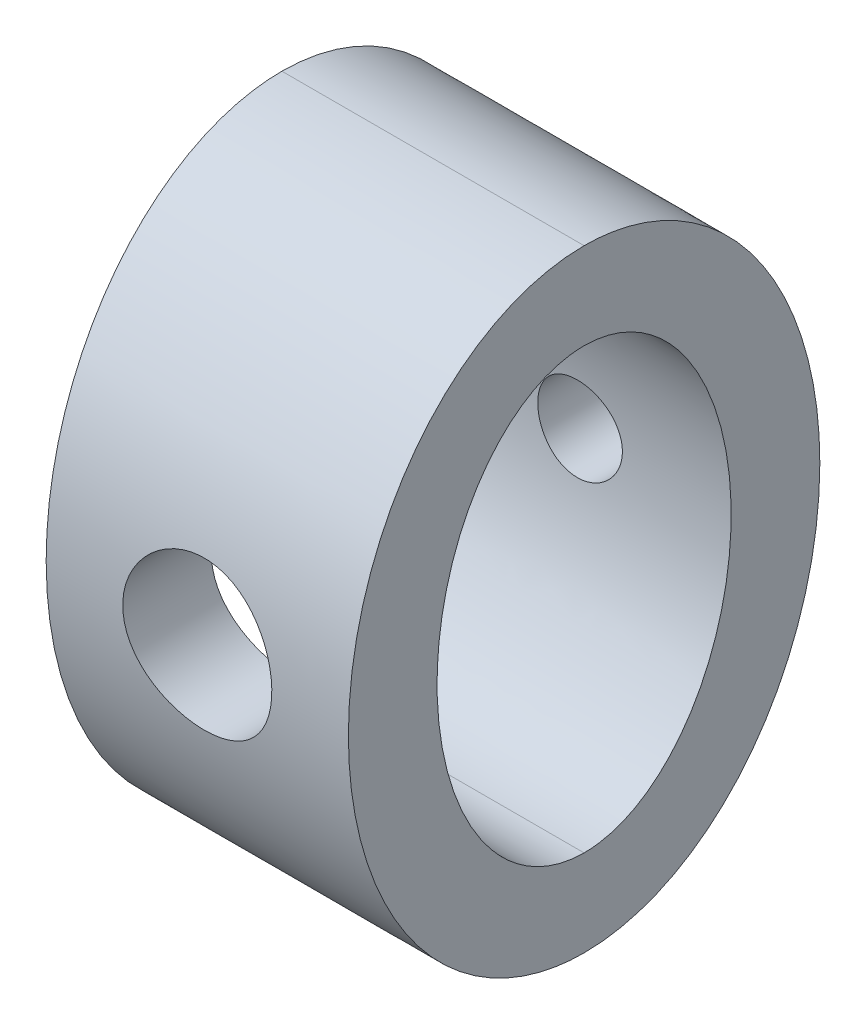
ISO-10303-21;
HEADER;
FILE_DESCRIPTION(('STEP AP214'),'2;1');
FILE_NAME('part.step','',(''),(''),'','','');
FILE_SCHEMA(('AUTOMOTIVE_DESIGN { 1 0 10303 214 1 1 1 1 }'));
ENDSEC;
DATA;
#1=APPLICATION_CONTEXT('core data for automotive mechanical design processes');
#2=APPLICATION_PROTOCOL_DEFINITION('international standard','automotive_design',2000,#1);
#3=PRODUCT_CONTEXT('',#1,'mechanical');
#4=PRODUCT('Part','Part','',(#3));
#5=PRODUCT_RELATED_PRODUCT_CATEGORY('part','',(#4));
#6=PRODUCT_DEFINITION_FORMATION('','',#4);
#7=PRODUCT_DEFINITION_CONTEXT('part definition',#1,'design');
#8=PRODUCT_DEFINITION('design','',#6,#7);
#9=PRODUCT_DEFINITION_SHAPE('','',#8);
#10=(LENGTH_UNIT() NAMED_UNIT(*) SI_UNIT(.MILLI.,.METRE.));
#11=(NAMED_UNIT(*) PLANE_ANGLE_UNIT() SI_UNIT($,.RADIAN.));
#12=(NAMED_UNIT(*) SI_UNIT($,.STERADIAN.) SOLID_ANGLE_UNIT());
#13=UNCERTAINTY_MEASURE_WITH_UNIT(LENGTH_MEASURE(1.E-05),#10,'distance_accuracy_value','');
#14=(GEOMETRIC_REPRESENTATION_CONTEXT(3) GLOBAL_UNCERTAINTY_ASSIGNED_CONTEXT((#13)) GLOBAL_UNIT_ASSIGNED_CONTEXT((#10,
#11,#12)) REPRESENTATION_CONTEXT('',''));
#15=CARTESIAN_POINT('',(0.,0.,0.));
#16=DIRECTION('',(0.,0.,1.));
#17=DIRECTION('',(1.,0.,0.));
#18=AXIS2_PLACEMENT_3D('',#15,#16,#17);
#19=CARTESIAN_POINT('',(9.525,13.843,14.859));
#20=CARTESIAN_POINT('',(-9.525,13.843,14.859));
#21=CARTESIAN_POINT('',(9.52499999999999,13.843,33.401));
#22=CARTESIAN_POINT('',(-9.52499999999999,13.843,33.401));
#23=CARTESIAN_POINT('',(9.52499999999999,-13.843,33.401));
#24=CARTESIAN_POINT('',(-9.52499999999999,-13.843,33.401));
#25=CARTESIAN_POINT('',(9.525,-13.843,14.859));
#26=CARTESIAN_POINT('',(-9.525,-13.843,14.859));
#27=(BOUNDED_SURFACE() B_SPLINE_SURFACE(3,1,((#19,#20),(#21,#22),(#23,#24),(#25,#26)),
.UNSPECIFIED.,.F.,.F.,.F.) B_SPLINE_SURFACE_WITH_KNOTS((4,4),(2,2),(0.,1.),(0.,1.),
.UNSPECIFIED.) GEOMETRIC_REPRESENTATION_ITEM() RATIONAL_B_SPLINE_SURFACE(((1.,1.),
(0.333333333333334,0.333333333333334),(0.333333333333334,0.333333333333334),(1.,1.))) REPRESENTATION_ITEM('') SURFACE());
#28=CARTESIAN_POINT('',(-1.38777878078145E-13,-4.699,23.5795275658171));
#29=CARTESIAN_POINT('',(0.129945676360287,-4.698999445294,23.5795279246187));
#30=CARTESIAN_POINT('',(0.259904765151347,-4.6936050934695,23.5808340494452));
#31=CARTESIAN_POINT('',(0.518927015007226,-4.67206760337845,23.5860190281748));
#32=CARTESIAN_POINT('',(0.647989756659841,-4.6559197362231,23.5898990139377));
#33=CARTESIAN_POINT('',(0.904434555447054,-4.61297355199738,23.6001178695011));
#34=CARTESIAN_POINT('',(1.03181377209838,-4.5861591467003,23.6064604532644));
#35=CARTESIAN_POINT('',(1.28383061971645,-4.52208959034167,23.6214088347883));
#36=CARTESIAN_POINT('',(1.40846717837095,-4.48483043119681,23.6300155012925));
#37=CARTESIAN_POINT('',(1.65383427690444,-4.40025335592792,23.6492085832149));
#38=CARTESIAN_POINT('',(1.77457247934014,-4.35295675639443,23.659790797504));
#39=CARTESIAN_POINT('',(2.01161546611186,-4.24862361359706,23.6826297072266));
#40=CARTESIAN_POINT('',(2.12791859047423,-4.19158346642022,23.6948870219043));
#41=CARTESIAN_POINT('',(2.46884259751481,-4.00650987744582,23.7336303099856));
#42=CARTESIAN_POINT('',(2.68580774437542,-3.86440913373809,23.7621148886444));
#43=CARTESIAN_POINT('',(3.09679475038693,-3.54396022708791,23.8217353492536));
#44=CARTESIAN_POINT('',(3.29034277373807,-3.3650152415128,23.8529092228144));
#45=CARTESIAN_POINT('',(3.64500301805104,-2.97717544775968,23.9140331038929));
#46=CARTESIAN_POINT('',(3.80611104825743,-2.76827677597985,23.9439829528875));
#47=CARTESIAN_POINT('',(4.09299070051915,-2.32354062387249,23.9997371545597));
#48=CARTESIAN_POINT('',(4.21834106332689,-2.08742461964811,24.0254906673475));
#49=CARTESIAN_POINT('',(4.42741055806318,-1.59678260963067,24.069605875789));
#50=CARTESIAN_POINT('',(4.51113503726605,-1.34225897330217,24.0879685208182));
#51=CARTESIAN_POINT('',(4.63314257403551,-0.826752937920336,24.1150418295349));
#52=CARTESIAN_POINT('',(4.67219390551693,-0.565961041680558,24.1239155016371));
#53=CARTESIAN_POINT('',(4.70616067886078,-0.0413850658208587,24.1316224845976));
#54=CARTESIAN_POINT('',(4.7010814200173,0.222398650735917,24.130457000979));
#55=CARTESIAN_POINT('',(4.64747055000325,0.740410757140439,24.1183277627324));
#56=CARTESIAN_POINT('',(4.59972854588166,0.994725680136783,24.1075420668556));
#57=CARTESIAN_POINT('',(4.46340509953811,1.49163964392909,24.0775350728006));
#58=CARTESIAN_POINT('',(4.3748216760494,1.73423811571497,24.0583133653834));
#59=CARTESIAN_POINT('',(4.1587032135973,2.20293872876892,24.0132399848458));
#60=CARTESIAN_POINT('',(4.03087768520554,2.42890171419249,23.9873391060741));
#61=CARTESIAN_POINT('',(3.74001148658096,2.85652026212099,23.9316426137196));
#62=CARTESIAN_POINT('',(3.57696797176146,3.05817385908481,23.9018466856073));
#63=CARTESIAN_POINT('',(3.30748929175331,3.34045307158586,23.8562668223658));
#64=CARTESIAN_POINT('',(3.21228438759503,3.43209756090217,23.8407447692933));
#65=CARTESIAN_POINT('',(3.01448757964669,3.60705827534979,23.8099395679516));
#66=CARTESIAN_POINT('',(2.91189831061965,3.69037744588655,23.7946563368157));
#67=CARTESIAN_POINT('',(2.69992134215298,3.84818237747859,23.7647501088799));
#68=CARTESIAN_POINT('',(2.59052804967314,3.92266072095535,23.7501276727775));
#69=CARTESIAN_POINT('',(2.36578789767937,4.06215839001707,23.7219874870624));
#70=CARTESIAN_POINT('',(2.25044334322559,4.12718134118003,23.7084693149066));
#71=CARTESIAN_POINT('',(2.01390141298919,4.24764810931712,23.6828660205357));
#72=CARTESIAN_POINT('',(1.8926755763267,4.30303781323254,23.6707891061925));
#73=CARTESIAN_POINT('',(1.64585360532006,4.403351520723,23.6485332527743));
#74=CARTESIAN_POINT('',(1.52025922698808,4.44827967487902,23.6383535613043));
#75=CARTESIAN_POINT('',(1.26577250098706,4.5272666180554,23.6202248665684));
#76=CARTESIAN_POINT('',(1.1368860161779,4.56134344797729,23.6122721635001));
#77=CARTESIAN_POINT('',(0.876612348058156,4.61842933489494,23.5988358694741));
#78=CARTESIAN_POINT('',(0.74522638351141,4.64144364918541,23.5933511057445));
#79=CARTESIAN_POINT('',(0.511506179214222,4.67220096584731,23.5859887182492));
#80=CARTESIAN_POINT('',(0.409485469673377,4.68224555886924,23.5835700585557));
#81=CARTESIAN_POINT('',(0.20497928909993,4.69564530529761,23.5803393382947));
#82=CARTESIAN_POINT('',(0.102493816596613,4.69900043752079,23.5795272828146));
#83=CARTESIAN_POINT('',(-0.129945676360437,4.698999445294,23.5795279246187));
#84=CARTESIAN_POINT('',(-0.259904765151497,4.6936050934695,23.5808340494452));
#85=CARTESIAN_POINT('',(-0.518927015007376,4.67206760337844,23.5860190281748));
#86=CARTESIAN_POINT('',(-0.64798975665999,4.65591973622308,23.5898990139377));
#87=CARTESIAN_POINT('',(-0.904434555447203,4.61297355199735,23.6001178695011));
#88=CARTESIAN_POINT('',(-1.03181377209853,4.58615914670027,23.6064604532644));
#89=CARTESIAN_POINT('',(-1.2838306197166,4.52208959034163,23.6214088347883));
#90=CARTESIAN_POINT('',(-1.40846717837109,4.48483043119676,23.6300155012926));
#91=CARTESIAN_POINT('',(-1.65383427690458,4.40025335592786,23.6492085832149));
#92=CARTESIAN_POINT('',(-1.77457247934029,4.35295675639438,23.659790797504));
#93=CARTESIAN_POINT('',(-2.011615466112,4.248623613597,23.6826297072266));
#94=CARTESIAN_POINT('',(-2.12791859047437,4.19158346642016,23.6948870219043));
#95=CARTESIAN_POINT('',(-2.46884259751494,4.00650987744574,23.7336303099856));
#96=CARTESIAN_POINT('',(-2.68580774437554,3.86440913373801,23.7621148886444));
#97=CARTESIAN_POINT('',(-3.09679475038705,3.54396022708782,23.8217353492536));
#98=CARTESIAN_POINT('',(-3.29034277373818,3.3650152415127,23.8529092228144));
#99=CARTESIAN_POINT('',(-3.64500301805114,2.97717544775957,23.9140331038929));
#100=CARTESIAN_POINT('',(-3.80611104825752,2.76827677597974,23.9439829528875));
#101=CARTESIAN_POINT('',(-4.09299070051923,2.32354062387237,23.9997371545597));
#102=CARTESIAN_POINT('',(-4.21834106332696,2.08742461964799,24.0254906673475));
#103=CARTESIAN_POINT('',(-4.42741055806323,1.59678260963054,24.069605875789));
#104=CARTESIAN_POINT('',(-4.5111350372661,1.34225897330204,24.0879685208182));
#105=CARTESIAN_POINT('',(-4.63314257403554,0.826752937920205,24.1150418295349));
#106=CARTESIAN_POINT('',(-4.67219390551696,0.565961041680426,24.1239155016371));
#107=CARTESIAN_POINT('',(-4.70616067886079,0.0413850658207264,24.1316224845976));
#108=CARTESIAN_POINT('',(-4.70108142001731,-0.222398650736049,24.130457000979));
#109=CARTESIAN_POINT('',(-4.64747055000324,-0.74041075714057,24.1183277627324));
#110=CARTESIAN_POINT('',(-4.59972854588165,-0.994725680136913,24.1075420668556));
#111=CARTESIAN_POINT('',(-4.46340509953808,-1.49163964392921,24.0775350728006));
#112=CARTESIAN_POINT('',(-4.37482167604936,-1.73423811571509,24.0583133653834));
#113=CARTESIAN_POINT('',(-4.15870321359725,-2.20293872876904,24.0132399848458));
#114=CARTESIAN_POINT('',(-4.03087768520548,-2.42890171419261,23.9873391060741));
#115=CARTESIAN_POINT('',(-3.74001148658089,-2.8565202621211,23.9316426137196));
#116=CARTESIAN_POINT('',(-3.57696797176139,-3.05817385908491,23.9018466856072));
#117=CARTESIAN_POINT('',(-3.30748929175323,-3.34045307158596,23.8562668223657));
#118=CARTESIAN_POINT('',(-3.21228438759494,-3.43209756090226,23.8407447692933));
#119=CARTESIAN_POINT('',(-3.0144875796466,-3.60705827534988,23.8099395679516));
#120=CARTESIAN_POINT('',(-2.91189831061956,-3.69037744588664,23.7946563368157));
#121=CARTESIAN_POINT('',(-2.69992134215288,-3.84818237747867,23.7647501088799));
#122=CARTESIAN_POINT('',(-2.59052804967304,-3.92266072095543,23.7501276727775));
#123=CARTESIAN_POINT('',(-2.36578789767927,-4.06215839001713,23.7219874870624));
#124=CARTESIAN_POINT('',(-2.25044334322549,-4.12718134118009,23.7084693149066));
#125=CARTESIAN_POINT('',(-2.01390141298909,-4.24764810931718,23.6828660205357));
#126=CARTESIAN_POINT('',(-1.89267557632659,-4.30303781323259,23.6707891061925));
#127=CARTESIAN_POINT('',(-1.64585360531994,-4.40335152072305,23.6485332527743));
#128=CARTESIAN_POINT('',(-1.52025922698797,-4.44827967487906,23.6383535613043));
#129=CARTESIAN_POINT('',(-1.26577250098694,-4.52726661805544,23.6202248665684));
#130=CARTESIAN_POINT('',(-1.13688601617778,-4.56134344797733,23.6122721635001));
#131=CARTESIAN_POINT('',(-0.876612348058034,-4.61842933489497,23.5988358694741));
#132=CARTESIAN_POINT('',(-0.745226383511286,-4.64144364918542,23.5933511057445));
#133=CARTESIAN_POINT('',(-0.511506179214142,-4.67220096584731,23.5859887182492));
#134=CARTESIAN_POINT('',(-0.409485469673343,-4.68224555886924,23.5835700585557));
#135=CARTESIAN_POINT('',(-0.204979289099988,-4.6956453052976,23.5803393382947));
#136=CARTESIAN_POINT('',(-0.102493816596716,-4.69900043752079,23.5795272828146));
#137=CARTESIAN_POINT('',(-1.38777878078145E-13,-4.699,23.5795275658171));
#138=B_SPLINE_CURVE_WITH_KNOTS('',3,(#28,#29,#30,#31,#32,#33,#34,#35,#36,#37,#38,#39,#40,#41,
#42,#43,#44,#45,#46,#47,#48,#49,#50,#51,#52,#53,#54,#55,#56,#57,#58,#59,#60,#61,#62,#63,#64,#65,
#66,#67,#68,#69,#70,#71,#72,#73,#74,#75,#76,#77,#78,#79,#80,#81,#82,#83,#84,#85,#86,#87,#88,#89,
#90,#91,#92,#93,#94,#95,#96,#97,#98,#99,#100,#101,#102,#103,#104,#105,#106,#107,#108,#109,#110,
#111,#112,#113,#114,#115,#116,#117,#118,#119,#120,#121,#122,#123,#124,#125,#126,#127,#128,#129,
#130,#131,#132,#133,#134,#135,#136,#137),.UNSPECIFIED.,.T.,.F.,(4,2,2,2,2,2,2,2,2,2,2,2,2,2,2,2,
2,2,2,2,2,2,2,2,2,2,2,2,2,2,2,2,2,2,2,2,2,2,2,2,2,2,2,2,2,2,2,2,2,2,2,2,2,2,4),(0.,
0.389742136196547,0.779655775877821,1.17015976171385,1.56081380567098,1.9506463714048,
2.34062344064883,3.11954072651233,3.9122389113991,4.70503943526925,5.50682679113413,
6.308511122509,7.0961906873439,7.88377566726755,8.65707908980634,9.43042003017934,
10.2096295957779,10.9889021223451,11.387682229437,11.7863207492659,12.1852914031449,
12.5841086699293,12.9850985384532,13.3859290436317,13.7860896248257,14.1860598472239,
14.4934654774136,14.8008720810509,15.1906142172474,15.5805278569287,15.9710318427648,
16.3616858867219,16.7515184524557,17.1414955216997,17.9204128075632,18.71311099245,
19.5059115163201,20.307698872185,21.1093832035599,21.8970627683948,22.6846477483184,
23.4579511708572,24.2312921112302,25.0105016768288,25.789774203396,26.1885543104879,
26.5871928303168,26.9861634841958,27.3849807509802,27.7859706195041,28.1868011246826,
28.5869617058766,28.9869319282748,29.2943375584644,29.6017441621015),.UNSPECIFIED.);
#139=CARTESIAN_POINT('',(-1.38777878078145E-13,-4.699,23.5795275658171));
#140=VERTEX_POINT('',#139);
#141=EDGE_CURVE('E20',#140,#140,#138,.T.);
#142=DIRECTION('',(1.,0.,0.));
#143=VECTOR('',#142,1.);
#144=CARTESIAN_POINT('',(0.,-13.843,14.859));
#145=LINE('',#144,#143);
#146=CARTESIAN_POINT('',(-9.525,-13.843,14.859));
#147=VERTEX_POINT('',#146);
#148=CARTESIAN_POINT('',(9.525,-13.843,14.859));
#149=VERTEX_POINT('',#148);
#150=EDGE_CURVE('E73',#147,#149,#145,.T.);
#151=CARTESIAN_POINT('',(-9.525,-13.843,14.859));
#152=CARTESIAN_POINT('',(-9.525,-13.8430018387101,14.9526989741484));
#153=CARTESIAN_POINT('',(-9.525,-13.8408784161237,15.046384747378));
#154=CARTESIAN_POINT('',(-9.525,-13.8324040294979,15.2335597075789));
#155=CARTESIAN_POINT('',(-9.525,-13.8260533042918,15.327048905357));
#156=CARTESIAN_POINT('',(-9.525,-13.8007100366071,15.6068083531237));
#157=CARTESIAN_POINT('',(-9.525,-13.7754263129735,15.7925457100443));
#158=CARTESIAN_POINT('',(-9.525,-13.7088658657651,16.1595946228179));
#159=CARTESIAN_POINT('',(-9.525,-13.6677152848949,16.340929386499));
#160=CARTESIAN_POINT('',(-9.525,-13.5702083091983,16.6994802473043));
#161=CARTESIAN_POINT('',(-9.525,-13.5138498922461,16.8766957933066));
#162=CARTESIAN_POINT('',(-9.525,-13.3871192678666,17.2254421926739));
#163=CARTESIAN_POINT('',(-9.525,-13.3167879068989,17.3969879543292));
#164=CARTESIAN_POINT('',(-9.525,-13.1631037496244,17.7341920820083));
#165=CARTESIAN_POINT('',(-9.525,-13.0797465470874,17.8998484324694));
#166=CARTESIAN_POINT('',(-9.525,-12.9010425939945,18.2249080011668));
#167=CARTESIAN_POINT('',(-9.525,-12.8056758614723,18.3843002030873));
#168=CARTESIAN_POINT('',(-9.525,-12.6042132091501,18.6961695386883));
#169=CARTESIAN_POINT('',(-9.525,-12.4981147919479,18.8486450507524));
#170=CARTESIAN_POINT('',(-9.525,-12.2205075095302,19.2213330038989));
#171=CARTESIAN_POINT('',(-9.525,-12.0429354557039,19.4370510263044));
#172=CARTESIAN_POINT('',(-9.525,-11.6695484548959,19.8519861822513));
#173=CARTESIAN_POINT('',(-9.525,-11.4737304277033,20.0512005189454));
#174=CARTESIAN_POINT('',(-9.525,-11.0664461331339,20.4336544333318));
#175=CARTESIAN_POINT('',(-9.525,-10.854951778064,20.6168639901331));
#176=CARTESIAN_POINT('',(-9.525,-10.4191810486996,20.9672882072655));
#177=CARTESIAN_POINT('',(-9.525,-10.1949046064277,21.1345027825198));
#178=CARTESIAN_POINT('',(-9.525,-9.63171224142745,21.5256977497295));
#179=CARTESIAN_POINT('',(-9.525,-9.2868402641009,21.7411303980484));
#180=CARTESIAN_POINT('',(-9.525,-8.57967714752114,22.1412263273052));
#181=CARTESIAN_POINT('',(-9.525,-8.21737850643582,22.3258762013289));
#182=CARTESIAN_POINT('',(-9.525,-7.47902181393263,22.6662189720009));
#183=CARTESIAN_POINT('',(-9.525,-7.10294962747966,22.8218810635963));
#184=CARTESIAN_POINT('',(-9.525,-6.34058627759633,23.1054776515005));
#185=CARTESIAN_POINT('',(-9.525,-5.95429535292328,23.2334127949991));
#186=CARTESIAN_POINT('',(-9.525,-5.03556776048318,23.5035097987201));
#187=CARTESIAN_POINT('',(-9.525,-4.49986841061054,23.6346369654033));
#188=CARTESIAN_POINT('',(-9.525,-3.41917444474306,23.8506873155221));
#189=CARTESIAN_POINT('',(-9.525,-2.87417668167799,23.9355945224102));
#190=CARTESIAN_POINT('',(-9.525,-1.77832625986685,24.0607246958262));
#191=CARTESIAN_POINT('',(-9.525,-1.22746646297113,24.1008848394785));
#192=CARTESIAN_POINT('',(-9.525,-0.124390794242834,24.1369981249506));
#193=CARTESIAN_POINT('',(-9.525,0.427824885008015,24.1329572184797));
#194=CARTESIAN_POINT('',(-9.525,1.53724392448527,24.0802796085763));
#195=CARTESIAN_POINT('',(-9.525,2.09442045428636,24.0310717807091));
#196=CARTESIAN_POINT('',(-9.525,3.20291825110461,23.8863559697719));
#197=CARTESIAN_POINT('',(-9.525,3.75423811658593,23.7908371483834));
#198=CARTESIAN_POINT('',(-9.525,4.8452225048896,23.5520473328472));
#199=CARTESIAN_POINT('',(-9.525,5.38491008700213,23.4088823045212));
#200=CARTESIAN_POINT('',(-9.525,6.44823055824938,23.0722013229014));
#201=CARTESIAN_POINT('',(-9.525,6.9718739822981,22.878719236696));
#202=CARTESIAN_POINT('',(-9.525,7.78469206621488,22.528882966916));
#203=CARTESIAN_POINT('',(-9.525,8.08150849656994,22.3901204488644));
#204=CARTESIAN_POINT('',(-9.525,8.66528835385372,22.0931372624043));
#205=CARTESIAN_POINT('',(-9.525,8.95225254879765,21.9349181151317));
#206=CARTESIAN_POINT('',(-9.525,9.51375037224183,21.5982772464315));
#207=CARTESIAN_POINT('',(-9.525,9.7882954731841,21.4198747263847));
#208=CARTESIAN_POINT('',(-9.525,10.3223769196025,21.0418359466));
#209=CARTESIAN_POINT('',(-9.525,10.5819169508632,20.842204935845));
#210=CARTESIAN_POINT('',(-9.525,11.0221868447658,20.4716432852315));
#211=CARTESIAN_POINT('',(-9.525,11.2068460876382,20.3053753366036));
#212=CARTESIAN_POINT('',(-9.525,11.5636563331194,19.9598609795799));
#213=CARTESIAN_POINT('',(-9.525,11.7358076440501,19.7806148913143));
#214=CARTESIAN_POINT('',(-9.525,12.0653035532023,19.4092374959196));
#215=CARTESIAN_POINT('',(-9.525,12.2226613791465,19.2171179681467));
#216=CARTESIAN_POINT('',(-9.525,12.5202915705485,18.8200627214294));
#217=CARTESIAN_POINT('',(-9.525,12.6605685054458,18.6151304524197));
#218=CARTESIAN_POINT('',(-9.525,12.89320967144,18.2386425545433));
#219=CARTESIAN_POINT('',(-9.525,12.9893793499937,18.0694342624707));
#220=CARTESIAN_POINT('',(-9.525,13.1682295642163,17.7240470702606));
#221=CARTESIAN_POINT('',(-9.525,13.2509131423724,17.5478697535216));
#222=CARTESIAN_POINT('',(-9.525,13.4013331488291,17.1895985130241));
#223=CARTESIAN_POINT('',(-9.525,13.4690968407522,17.0075160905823));
#224=CARTESIAN_POINT('',(-9.525,13.5886110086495,16.6382379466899));
#225=CARTESIAN_POINT('',(-9.525,13.640366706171,16.4510439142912));
#226=CARTESIAN_POINT('',(-9.525,13.7360907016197,16.0321844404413));
#227=CARTESIAN_POINT('',(-9.525,13.776026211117,15.7995701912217));
#228=CARTESIAN_POINT('',(-9.525,13.8161253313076,15.4483016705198));
#229=CARTESIAN_POINT('',(-9.525,13.826191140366,15.3306987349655));
#230=CARTESIAN_POINT('',(-9.525,13.839631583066,15.0950736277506));
#231=CARTESIAN_POINT('',(-9.525,13.8430040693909,14.9770513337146));
#232=CARTESIAN_POINT('',(-9.525,13.843,14.859));
#233=B_SPLINE_CURVE_WITH_KNOTS('',3,(#151,#152,#153,#154,#155,#156,#157,#158,#159,#160,#161,
#162,#163,#164,#165,#166,#167,#168,#169,#170,#171,#172,#173,#174,#175,#176,#177,#178,#179,#180,
#181,#182,#183,#184,#185,#186,#187,#188,#189,#190,#191,#192,#193,#194,#195,#196,#197,#198,#199,
#200,#201,#202,#203,#204,#205,#206,#207,#208,#209,#210,#211,#212,#213,#214,#215,#216,#217,#218,
#219,#220,#221,#222,#223,#224,#225,#226,#227,#228,#229,#230,#231,#232),.UNSPECIFIED.,.F.,.F.,(4,
2,2,2,2,2,2,2,2,2,2,2,2,2,2,2,2,2,2,2,2,2,2,2,2,2,2,2,2,2,2,2,2,2,2,2,2,2,2,2,4),(0.,
0.281046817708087,0.56207775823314,1.12361581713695,1.68077870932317,2.23801572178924,
2.79364714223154,3.34946692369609,3.90622403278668,4.46311100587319,5.30003680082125,
6.13710413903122,6.97570932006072,7.81431896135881,9.03236440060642,10.2509389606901,
11.4708011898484,12.690634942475,14.342906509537,15.9957488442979,17.6509087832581,
19.3058458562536,20.9820018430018,22.6585502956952,24.3313947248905,26.0031161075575,
26.9854607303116,27.9677286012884,28.9490697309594,29.930168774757,30.675045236,
31.4199033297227,32.1640889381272,32.9080750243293,33.4914225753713,34.0746383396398,
34.6567793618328,35.23873029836,35.9451425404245,36.2990778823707,36.6531267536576),.UNSPECIFIED.);
#234=CARTESIAN_POINT('',(-9.525,13.843,14.859));
#235=VERTEX_POINT('',#234);
#236=EDGE_CURVE('E58',#147,#235,#233,.T.);
#237=DIRECTION('',(-1.,0.,0.));
#238=VECTOR('',#237,1.);
#239=CARTESIAN_POINT('',(0.,13.843,14.859));
#240=LINE('',#239,#238);
#241=CARTESIAN_POINT('',(9.525,13.843,14.859));
#242=VERTEX_POINT('',#241);
#243=EDGE_CURVE('E64',#242,#235,#240,.T.);
#244=CARTESIAN_POINT('',(9.525,-13.843,14.859));
#245=CARTESIAN_POINT('',(9.525,-13.8430018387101,14.9526989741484));
#246=CARTESIAN_POINT('',(9.525,-13.8408784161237,15.046384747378));
#247=CARTESIAN_POINT('',(9.525,-13.8324040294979,15.2335597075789));
#248=CARTESIAN_POINT('',(9.525,-13.8260533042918,15.327048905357));
#249=CARTESIAN_POINT('',(9.525,-13.8007100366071,15.6068083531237));
#250=CARTESIAN_POINT('',(9.525,-13.7754263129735,15.7925457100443));
#251=CARTESIAN_POINT('',(9.525,-13.7088658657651,16.1595946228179));
#252=CARTESIAN_POINT('',(9.525,-13.6677152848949,16.340929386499));
#253=CARTESIAN_POINT('',(9.525,-13.5702083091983,16.6994802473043));
#254=CARTESIAN_POINT('',(9.525,-13.5138498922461,16.8766957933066));
#255=CARTESIAN_POINT('',(9.525,-13.3871192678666,17.2254421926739));
#256=CARTESIAN_POINT('',(9.525,-13.3167879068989,17.3969879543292));
#257=CARTESIAN_POINT('',(9.525,-13.1631037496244,17.7341920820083));
#258=CARTESIAN_POINT('',(9.525,-13.0797465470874,17.8998484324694));
#259=CARTESIAN_POINT('',(9.525,-12.9010425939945,18.2249080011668));
#260=CARTESIAN_POINT('',(9.525,-12.8056758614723,18.3843002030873));
#261=CARTESIAN_POINT('',(9.525,-12.6042132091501,18.6961695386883));
#262=CARTESIAN_POINT('',(9.525,-12.4981147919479,18.8486450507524));
#263=CARTESIAN_POINT('',(9.525,-12.2205075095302,19.2213330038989));
#264=CARTESIAN_POINT('',(9.525,-12.0429354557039,19.4370510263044));
#265=CARTESIAN_POINT('',(9.525,-11.6695484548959,19.8519861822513));
#266=CARTESIAN_POINT('',(9.525,-11.4737304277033,20.0512005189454));
#267=CARTESIAN_POINT('',(9.525,-11.0664461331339,20.4336544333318));
#268=CARTESIAN_POINT('',(9.525,-10.854951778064,20.6168639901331));
#269=CARTESIAN_POINT('',(9.525,-10.4191810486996,20.9672882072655));
#270=CARTESIAN_POINT('',(9.525,-10.1949046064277,21.1345027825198));
#271=CARTESIAN_POINT('',(9.525,-9.63171224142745,21.5256977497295));
#272=CARTESIAN_POINT('',(9.525,-9.2868402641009,21.7411303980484));
#273=CARTESIAN_POINT('',(9.525,-8.57967714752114,22.1412263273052));
#274=CARTESIAN_POINT('',(9.525,-8.21737850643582,22.3258762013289));
#275=CARTESIAN_POINT('',(9.525,-7.47902181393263,22.6662189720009));
#276=CARTESIAN_POINT('',(9.525,-7.10294962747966,22.8218810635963));
#277=CARTESIAN_POINT('',(9.525,-6.34058627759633,23.1054776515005));
#278=CARTESIAN_POINT('',(9.525,-5.95429535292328,23.2334127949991));
#279=CARTESIAN_POINT('',(9.525,-5.03556776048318,23.5035097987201));
#280=CARTESIAN_POINT('',(9.525,-4.49986841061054,23.6346369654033));
#281=CARTESIAN_POINT('',(9.525,-3.41917444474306,23.8506873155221));
#282=CARTESIAN_POINT('',(9.525,-2.87417668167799,23.9355945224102));
#283=CARTESIAN_POINT('',(9.525,-1.77832625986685,24.0607246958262));
#284=CARTESIAN_POINT('',(9.525,-1.22746646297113,24.1008848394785));
#285=CARTESIAN_POINT('',(9.525,-0.124390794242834,24.1369981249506));
#286=CARTESIAN_POINT('',(9.525,0.427824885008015,24.1329572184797));
#287=CARTESIAN_POINT('',(9.525,1.53724392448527,24.0802796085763));
#288=CARTESIAN_POINT('',(9.525,2.09442045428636,24.0310717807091));
#289=CARTESIAN_POINT('',(9.525,3.20291825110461,23.8863559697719));
#290=CARTESIAN_POINT('',(9.525,3.75423811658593,23.7908371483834));
#291=CARTESIAN_POINT('',(9.525,4.8452225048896,23.5520473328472));
#292=CARTESIAN_POINT('',(9.525,5.38491008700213,23.4088823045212));
#293=CARTESIAN_POINT('',(9.525,6.44823055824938,23.0722013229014));
#294=CARTESIAN_POINT('',(9.525,6.9718739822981,22.878719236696));
#295=CARTESIAN_POINT('',(9.525,7.78469206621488,22.528882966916));
#296=CARTESIAN_POINT('',(9.525,8.08150849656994,22.3901204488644));
#297=CARTESIAN_POINT('',(9.525,8.66528835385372,22.0931372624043));
#298=CARTESIAN_POINT('',(9.525,8.95225254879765,21.9349181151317));
#299=CARTESIAN_POINT('',(9.525,9.51375037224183,21.5982772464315));
#300=CARTESIAN_POINT('',(9.525,9.7882954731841,21.4198747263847));
#301=CARTESIAN_POINT('',(9.525,10.3223769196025,21.0418359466));
#302=CARTESIAN_POINT('',(9.525,10.5819169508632,20.842204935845));
#303=CARTESIAN_POINT('',(9.525,11.0221868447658,20.4716432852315));
#304=CARTESIAN_POINT('',(9.525,11.2068460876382,20.3053753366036));
#305=CARTESIAN_POINT('',(9.525,11.5636563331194,19.9598609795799));
#306=CARTESIAN_POINT('',(9.525,11.7358076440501,19.7806148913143));
#307=CARTESIAN_POINT('',(9.525,12.0653035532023,19.4092374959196));
#308=CARTESIAN_POINT('',(9.525,12.2226613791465,19.2171179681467));
#309=CARTESIAN_POINT('',(9.525,12.5202915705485,18.8200627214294));
#310=CARTESIAN_POINT('',(9.525,12.6605685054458,18.6151304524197));
#311=CARTESIAN_POINT('',(9.525,12.89320967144,18.2386425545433));
#312=CARTESIAN_POINT('',(9.525,12.9893793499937,18.0694342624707));
#313=CARTESIAN_POINT('',(9.525,13.1682295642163,17.7240470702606));
#314=CARTESIAN_POINT('',(9.525,13.2509131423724,17.5478697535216));
#315=CARTESIAN_POINT('',(9.525,13.4013331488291,17.1895985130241));
#316=CARTESIAN_POINT('',(9.525,13.4690968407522,17.0075160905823));
#317=CARTESIAN_POINT('',(9.525,13.5886110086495,16.6382379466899));
#318=CARTESIAN_POINT('',(9.525,13.640366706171,16.4510439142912));
#319=CARTESIAN_POINT('',(9.525,13.7360907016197,16.0321844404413));
#320=CARTESIAN_POINT('',(9.525,13.776026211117,15.7995701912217));
#321=CARTESIAN_POINT('',(9.525,13.8161253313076,15.4483016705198));
#322=CARTESIAN_POINT('',(9.525,13.826191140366,15.3306987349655));
#323=CARTESIAN_POINT('',(9.525,13.839631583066,15.0950736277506));
#324=CARTESIAN_POINT('',(9.525,13.8430040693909,14.9770513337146));
#325=CARTESIAN_POINT('',(9.525,13.843,14.859));
#326=B_SPLINE_CURVE_WITH_KNOTS('',3,(#244,#245,#246,#247,#248,#249,#250,#251,#252,#253,#254,
#255,#256,#257,#258,#259,#260,#261,#262,#263,#264,#265,#266,#267,#268,#269,#270,#271,#272,#273,
#274,#275,#276,#277,#278,#279,#280,#281,#282,#283,#284,#285,#286,#287,#288,#289,#290,#291,#292,
#293,#294,#295,#296,#297,#298,#299,#300,#301,#302,#303,#304,#305,#306,#307,#308,#309,#310,#311,
#312,#313,#314,#315,#316,#317,#318,#319,#320,#321,#322,#323,#324,#325),.UNSPECIFIED.,.F.,.F.,(4,
2,2,2,2,2,2,2,2,2,2,2,2,2,2,2,2,2,2,2,2,2,2,2,2,2,2,2,2,2,2,2,2,2,2,2,2,2,2,2,4),(0.,
0.281046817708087,0.56207775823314,1.12361581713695,1.68077870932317,2.23801572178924,
2.79364714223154,3.34946692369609,3.90622403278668,4.46311100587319,5.30003680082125,
6.13710413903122,6.97570932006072,7.81431896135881,9.03236440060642,10.2509389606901,
11.4708011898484,12.690634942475,14.342906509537,15.9957488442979,17.6509087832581,
19.3058458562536,20.9820018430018,22.6585502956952,24.3313947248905,26.0031161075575,
26.9854607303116,27.9677286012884,28.9490697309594,29.930168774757,30.675045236,
31.4199033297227,32.1640889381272,32.9080750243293,33.4914225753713,34.0746383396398,
34.6567793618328,35.23873029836,35.9451425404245,36.2990778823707,36.6531267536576),.UNSPECIFIED.);
#327=EDGE_CURVE('E178',#149,#242,#326,.T.);
#328=ORIENTED_EDGE('',*,*,#141,.T.);
#329=EDGE_LOOP('',(#328));
#330=FACE_BOUND('',#329,.T.);
#331=ORIENTED_EDGE('',*,*,#150,.F.);
#332=ORIENTED_EDGE('',*,*,#236,.T.);
#333=ORIENTED_EDGE('',*,*,#243,.F.);
#334=ORIENTED_EDGE('',*,*,#327,.F.);
#335=EDGE_LOOP('',(#331,#332,#333,#334));
#336=FACE_BOUND('',#335,.T.);
#337=ADVANCED_FACE('F14',(#330,#336),#27,.T.);
#338=CARTESIAN_POINT('',(0.,0.,34.925));
#339=DIRECTION('',(0.,0.,-1.));
#340=DIRECTION('',(0.,1.,0.));
#341=AXIS2_PLACEMENT_3D('',#338,#339,#340);
#342=CYLINDRICAL_SURFACE('',#341,4.699);
#343=CARTESIAN_POINT('',(1.95676808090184E-11,-4.699,29.2710518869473));
#344=CARTESIAN_POINT('',(0.130622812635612,-4.69899936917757,29.2710522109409));
#345=CARTESIAN_POINT('',(0.261262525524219,-4.69354879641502,29.2721069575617));
#346=CARTESIAN_POINT('',(0.521650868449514,-4.67178358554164,29.2762959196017));
#347=CARTESIAN_POINT('',(0.651399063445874,-4.65546397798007,29.2794310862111));
#348=CARTESIAN_POINT('',(0.909228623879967,-4.61205161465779,29.2876939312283));
#349=CARTESIAN_POINT('',(1.03730703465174,-4.58494189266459,29.2928247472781));
#350=CARTESIAN_POINT('',(1.29072224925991,-4.52014919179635,29.3049279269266));
#351=CARTESIAN_POINT('',(1.41605798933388,-4.48246218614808,29.3119009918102));
#352=CARTESIAN_POINT('',(1.66283961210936,-4.39688427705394,29.3274678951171));
#353=CARTESIAN_POINT('',(1.7842920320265,-4.34901168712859,29.3360588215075));
#354=CARTESIAN_POINT('',(2.02275093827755,-4.24335863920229,29.3546236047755));
#355=CARTESIAN_POINT('',(2.13975576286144,-4.18557452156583,29.3645979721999));
#356=CARTESIAN_POINT('',(2.36839799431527,-4.06057328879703,29.3856340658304));
#357=CARTESIAN_POINT('',(2.48003924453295,-3.99336306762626,29.3966949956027));
#358=CARTESIAN_POINT('',(2.69734193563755,-3.84992247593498,29.4196029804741));
#359=CARTESIAN_POINT('',(2.80300112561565,-3.77368874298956,29.4314503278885));
#360=CARTESIAN_POINT('',(3.00873962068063,-3.61184276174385,29.4557330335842));
#361=CARTESIAN_POINT('',(3.10874339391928,-3.5261352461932,29.4681734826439));
#362=CARTESIAN_POINT('',(3.30123501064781,-3.34660662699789,29.4931724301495));
#363=CARTESIAN_POINT('',(3.393720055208,-3.25278252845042,29.5057309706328));
#364=CARTESIAN_POINT('',(3.57048099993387,-3.05770934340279,29.5306082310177));
#365=CARTESIAN_POINT('',(3.65475894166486,-2.95646211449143,29.5429270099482));
#366=CARTESIAN_POINT('',(3.81457858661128,-2.74716838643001,29.5669908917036));
#367=CARTESIAN_POINT('',(3.89011705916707,-2.63911939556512,29.5787357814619));
#368=CARTESIAN_POINT('',(4.03240125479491,-2.41618558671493,29.6014037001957));
#369=CARTESIAN_POINT('',(4.09907948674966,-2.30125700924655,29.6123201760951));
#370=CARTESIAN_POINT('',(4.2225283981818,-2.0660357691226,29.6329337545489));
#371=CARTESIAN_POINT('',(4.27929536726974,-1.94574111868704,29.6426304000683));
#372=CARTESIAN_POINT('',(4.38243941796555,-1.70073039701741,29.6605223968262));
#373=CARTESIAN_POINT('',(4.42882109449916,-1.57601630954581,29.6687184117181));
#374=CARTESIAN_POINT('',(4.51088236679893,-1.32296731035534,29.6833858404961));
#375=CARTESIAN_POINT('',(4.5465580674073,-1.19463109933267,29.6898566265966));
#376=CARTESIAN_POINT('',(4.60653301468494,-0.936877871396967,29.7008181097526));
#377=CARTESIAN_POINT('',(4.63096494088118,-0.807492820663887,29.7053318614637));
#378=CARTESIAN_POINT('',(4.66890485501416,-0.547064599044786,29.7123718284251));
#379=CARTESIAN_POINT('',(4.68240881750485,-0.416020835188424,29.7148973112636));
#380=CARTESIAN_POINT('',(4.70629162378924,-0.0219453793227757,29.7193584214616));
#381=CARTESIAN_POINT('',(4.70011222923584,0.242335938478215,29.7181919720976));
#382=CARTESIAN_POINT('',(4.64400978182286,0.762549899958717,29.707740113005));
#383=CARTESIAN_POINT('',(4.59463214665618,1.01854551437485,29.6985559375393));
#384=CARTESIAN_POINT('',(4.45441799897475,1.51859765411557,29.673205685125));
#385=CARTESIAN_POINT('',(4.36357971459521,1.76265366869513,29.6570393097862));
#386=CARTESIAN_POINT('',(4.14253363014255,2.23339970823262,29.6193487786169));
#387=CARTESIAN_POINT('',(4.0121079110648,2.45998467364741,29.5977950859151));
#388=CARTESIAN_POINT('',(3.71563161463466,2.88832775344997,29.5516768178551));
#389=CARTESIAN_POINT('',(3.54958003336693,3.09008516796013,29.527112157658));
#390=CARTESIAN_POINT('',(3.27603903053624,3.37130607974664,29.4898329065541));
#391=CARTESIAN_POINT('',(3.17991901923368,3.46210951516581,29.4772327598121));
#392=CARTESIAN_POINT('',(2.98036387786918,3.63530682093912,29.4522991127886));
#393=CARTESIAN_POINT('',(2.87693139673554,3.71770371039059,29.4399655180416));
#394=CARTESIAN_POINT('',(2.6633617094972,3.87357788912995,29.4159049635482));
#395=CARTESIAN_POINT('',(2.55321902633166,3.9470477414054,29.4041785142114));
#396=CARTESIAN_POINT('',(2.32709692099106,4.08444777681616,29.3816850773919));
#397=CARTESIAN_POINT('',(2.21111973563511,4.14838157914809,29.3709177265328));
#398=CARTESIAN_POINT('',(1.97372756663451,4.26645396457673,29.3506215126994));
#399=CARTESIAN_POINT('',(1.85229690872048,4.32056171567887,29.3410965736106));
#400=CARTESIAN_POINT('',(1.60523676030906,4.41830920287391,29.3236124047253));
#401=CARTESIAN_POINT('',(1.47960892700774,4.46195301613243,29.3156525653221));
#402=CARTESIAN_POINT('',(1.22522832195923,4.5383947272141,29.3015470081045));
#403=CARTESIAN_POINT('',(1.09648114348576,4.57121068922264,29.2953982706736));
#404=CARTESIAN_POINT('',(0.836645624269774,4.62582279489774,29.2850877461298));
#405=CARTESIAN_POINT('',(0.705558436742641,4.64762421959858,29.2809250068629));
#406=CARTESIAN_POINT('',(0.478637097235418,4.67554284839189,29.2755741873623));
#407=CARTESIAN_POINT('',(0.383135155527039,4.6843355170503,29.2738808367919));
#408=CARTESIAN_POINT('',(0.191758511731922,4.69606432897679,29.2716195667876));
#409=CARTESIAN_POINT('',(0.0958838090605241,4.69900046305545,29.2710516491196));
#410=CARTESIAN_POINT('',(-0.13062281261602,4.69899936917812,29.2710522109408));
#411=CARTESIAN_POINT('',(-0.261262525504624,4.69354879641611,29.2721069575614));
#412=CARTESIAN_POINT('',(-0.521650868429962,4.67178358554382,29.2762959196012));
#413=CARTESIAN_POINT('',(-0.651399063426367,4.6554639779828,29.2794310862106));
#414=CARTESIAN_POINT('',(-0.909228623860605,4.61205161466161,29.2876939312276));
#415=CARTESIAN_POINT('',(-1.03730703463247,4.58494189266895,29.2928247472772));
#416=CARTESIAN_POINT('',(-1.29072224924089,4.52014919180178,29.3049279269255));
#417=CARTESIAN_POINT('',(-1.41605798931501,4.48246218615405,29.3119009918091));
#418=CARTESIAN_POINT('',(-1.66283961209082,4.39688427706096,29.3274678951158));
#419=CARTESIAN_POINT('',(-1.78429203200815,4.34901168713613,29.3360588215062));
#420=CARTESIAN_POINT('',(-2.02275093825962,4.24335863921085,29.354623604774));
#421=CARTESIAN_POINT('',(-2.13975576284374,4.18557452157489,29.3645979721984));
#422=CARTESIAN_POINT('',(-2.36839799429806,4.06057328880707,29.3856340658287));
#423=CARTESIAN_POINT('',(-2.48003924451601,3.99336306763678,29.396694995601));
#424=CARTESIAN_POINT('',(-2.69734193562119,3.84992247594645,29.4196029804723));
#425=CARTESIAN_POINT('',(-2.8030011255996,3.7736887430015,29.4314503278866));
#426=CARTESIAN_POINT('',(-3.00873962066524,3.61184276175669,29.4557330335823));
#427=CARTESIAN_POINT('',(-3.10874339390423,3.52613524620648,29.468173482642));
#428=CARTESIAN_POINT('',(-3.30123501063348,3.34660662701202,29.4931724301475));
#429=CARTESIAN_POINT('',(-3.39372005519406,3.25278252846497,29.5057309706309));
#430=CARTESIAN_POINT('',(-3.57048099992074,3.05770934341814,29.5306082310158));
#431=CARTESIAN_POINT('',(-3.65475894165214,2.95646211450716,29.5429270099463));
#432=CARTESIAN_POINT('',(-3.81457858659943,2.74716838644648,29.5669908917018));
#433=CARTESIAN_POINT('',(-3.89011705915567,2.63911939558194,29.5787357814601));
#434=CARTESIAN_POINT('',(-4.03240125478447,2.41618558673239,29.6014037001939));
#435=CARTESIAN_POINT('',(-4.09907948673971,2.3012570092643,29.6123201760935));
#436=CARTESIAN_POINT('',(-4.22252839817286,2.06603576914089,29.6329337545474));
#437=CARTESIAN_POINT('',(-4.27929536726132,1.94574111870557,29.6426304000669));
#438=CARTESIAN_POINT('',(-4.38243941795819,1.70073039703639,29.6605223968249));
#439=CARTESIAN_POINT('',(-4.42882109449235,1.57601630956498,29.6687184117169));
#440=CARTESIAN_POINT('',(-4.51088236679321,1.32296731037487,29.6833858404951));
#441=CARTESIAN_POINT('',(-4.54655806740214,1.19463109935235,29.6898566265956));
#442=CARTESIAN_POINT('',(-4.60653301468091,0.936877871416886,29.7008181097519));
#443=CARTESIAN_POINT('',(-4.6309649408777,0.807492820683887,29.705331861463));
#444=CARTESIAN_POINT('',(-4.66890485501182,0.547064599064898,29.7123718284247));
#445=CARTESIAN_POINT('',(-4.68240881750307,0.416020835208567,29.7148973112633));
#446=CARTESIAN_POINT('',(-4.70629162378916,0.0219453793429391,29.7193584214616));
#447=CARTESIAN_POINT('',(-4.70011222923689,-0.242335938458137,29.7181919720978));
#448=CARTESIAN_POINT('',(-4.64400978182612,-0.762549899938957,29.7077401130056));
#449=CARTESIAN_POINT('',(-4.59463214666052,-1.01854551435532,29.6985559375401));
#450=CARTESIAN_POINT('',(-4.4544179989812,-1.51859765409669,29.6732056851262));
#451=CARTESIAN_POINT('',(-4.36357971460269,-1.76265366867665,29.6570393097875));
#452=CARTESIAN_POINT('',(-4.14253363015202,-2.23339970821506,29.6193487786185));
#453=CARTESIAN_POINT('',(-4.01210791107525,-2.45998467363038,29.5977950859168));
#454=CARTESIAN_POINT('',(-3.71563161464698,-2.88832775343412,29.551676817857));
#455=CARTESIAN_POINT('',(-3.54958003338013,-3.09008516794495,29.5271121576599));
#456=CARTESIAN_POINT('',(-3.27603903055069,-3.37130607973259,29.489832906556));
#457=CARTESIAN_POINT('',(-3.17991901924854,-3.46210951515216,29.477232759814));
#458=CARTESIAN_POINT('',(-2.98036387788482,-3.63530682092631,29.4522991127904));
#459=CARTESIAN_POINT('',(-2.87693139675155,-3.71770371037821,29.4399655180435));
#460=CARTESIAN_POINT('',(-2.66336170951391,-3.87357788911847,29.41590496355));
#461=CARTESIAN_POINT('',(-2.55321902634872,-3.94704774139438,29.4041785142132));
#462=CARTESIAN_POINT('',(-2.32709692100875,-4.08444777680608,29.3816850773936));
#463=CARTESIAN_POINT('',(-2.21111973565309,-4.14838157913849,29.3709177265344));
#464=CARTESIAN_POINT('',(-1.97372756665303,-4.26645396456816,29.3506215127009));
#465=CARTESIAN_POINT('',(-1.85229690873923,-4.32056171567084,29.341096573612));
#466=CARTESIAN_POINT('',(-1.60523676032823,-4.41830920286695,29.3236124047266));
#467=CARTESIAN_POINT('',(-1.47960892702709,-4.46195301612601,29.3156525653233));
#468=CARTESIAN_POINT('',(-1.22522832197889,-4.5383947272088,29.3015470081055));
#469=CARTESIAN_POINT('',(-1.09648114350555,-4.5712106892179,29.2953982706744));
#470=CARTESIAN_POINT('',(-0.836645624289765,-4.62582279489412,29.2850877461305));
#471=CARTESIAN_POINT('',(-0.705558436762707,-4.64762421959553,29.2809250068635));
#472=CARTESIAN_POINT('',(-0.478637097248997,-4.67554284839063,29.2755741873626));
#473=CARTESIAN_POINT('',(-0.383135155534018,-4.68433551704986,29.273880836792));
#474=CARTESIAN_POINT('',(-0.19175851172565,-4.69606432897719,29.2716195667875));
#475=CARTESIAN_POINT('',(-0.0958838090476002,-4.69900046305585,29.2710516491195));
#476=CARTESIAN_POINT('',(1.95676808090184E-11,-4.699,29.2710518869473));
#477=B_SPLINE_CURVE_WITH_KNOTS('',3,(#343,#344,#345,#346,#347,#348,#349,#350,#351,#352,#353,
#354,#355,#356,#357,#358,#359,#360,#361,#362,#363,#364,#365,#366,#367,#368,#369,#370,#371,#372,
#373,#374,#375,#376,#377,#378,#379,#380,#381,#382,#383,#384,#385,#386,#387,#388,#389,#390,#391,
#392,#393,#394,#395,#396,#397,#398,#399,#400,#401,#402,#403,#404,#405,#406,#407,#408,#409,#410,
#411,#412,#413,#414,#415,#416,#417,#418,#419,#420,#421,#422,#423,#424,#425,#426,#427,#428,#429,
#430,#431,#432,#433,#434,#435,#436,#437,#438,#439,#440,#441,#442,#443,#444,#445,#446,#447,#448,
#449,#450,#451,#452,#453,#454,#455,#456,#457,#458,#459,#460,#461,#462,#463,#464,#465,#466,#467,
#468,#469,#470,#471,#472,#473,#474,#475,#476),.UNSPECIFIED.,.T.,.F.,(4,2,2,2,2,2,2,2,2,2,2,2,2,
2,2,2,2,2,2,2,2,2,2,2,2,2,2,2,2,2,2,2,2,2,2,2,2,2,2,2,2,2,2,2,2,2,2,2,2,2,2,2,2,2,2,2,2,2,2,2,2,
2,2,2,2,2,4),(0.,0.391780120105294,0.783739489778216,1.17631762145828,1.56904541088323,
1.96107296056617,2.35324557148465,2.74513284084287,3.13716660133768,3.53358044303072,
3.93014118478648,4.32660302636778,4.72321096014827,5.12268520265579,5.52230867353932,
5.92175498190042,6.32134644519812,6.71609343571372,7.1109857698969,7.89984106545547,
8.67887778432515,9.45794779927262,10.2413866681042,11.0248476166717,11.4229438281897,
11.8208965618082,12.2191785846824,12.6173090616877,13.0166679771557,13.4158710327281,
13.8144046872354,14.2127470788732,14.5003332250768,14.7879198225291,15.1796999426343,
15.5716593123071,15.9642374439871,16.356965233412,16.7489927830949,17.1411653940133,
17.5330526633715,17.9250864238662,18.3215002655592,18.7180610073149,19.1145228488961,
19.5111307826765,19.910605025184,20.3102284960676,20.7096748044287,21.1092662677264,
21.5040132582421,21.8989055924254,22.6877608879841,23.4667976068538,24.2458676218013,
25.0293064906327,25.8127674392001,26.2108636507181,26.6088163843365,27.0070984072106,
27.4052288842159,27.8045877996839,28.2037908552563,28.6023245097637,29.0006669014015,
29.2882530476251,29.5758396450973),.UNSPECIFIED.);
#478=CARTESIAN_POINT('',(1.95676808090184E-11,-4.699,29.2710518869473));
#479=VERTEX_POINT('',#478);
#480=EDGE_CURVE('E120',#479,#479,#477,.T.);
#481=ORIENTED_EDGE('',*,*,#480,.T.);
#482=EDGE_LOOP('',(#481));
#483=FACE_BOUND('',#482,.T.);
#484=ORIENTED_EDGE('',*,*,#141,.F.);
#485=EDGE_LOOP('',(#484));
#486=FACE_BOUND('',#485,.T.);
#487=ADVANCED_FACE('F232',(#483,#486),#342,.F.);
#488=CARTESIAN_POINT('',(9.525,-13.843,14.859));
#489=CARTESIAN_POINT('',(-9.525,-13.843,14.859));
#490=CARTESIAN_POINT('',(9.52499999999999,-13.843,-3.68299999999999));
#491=CARTESIAN_POINT('',(-9.52499999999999,-13.843,-3.68299999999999));
#492=CARTESIAN_POINT('',(9.52499999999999,13.843,-3.68299999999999));
#493=CARTESIAN_POINT('',(-9.52499999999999,13.843,-3.68299999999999));
#494=CARTESIAN_POINT('',(9.525,13.843,14.859));
#495=CARTESIAN_POINT('',(-9.525,13.843,14.859));
#496=(BOUNDED_SURFACE() B_SPLINE_SURFACE(3,1,((#488,#489),(#490,#491),(#492,#493),(#494,#495)),
.UNSPECIFIED.,.F.,.F.,.F.) B_SPLINE_SURFACE_WITH_KNOTS((4,4),(2,2),(0.,1.),(0.,1.),
.UNSPECIFIED.) GEOMETRIC_REPRESENTATION_ITEM() RATIONAL_B_SPLINE_SURFACE(((1.,1.),
(0.333333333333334,0.333333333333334),(0.333333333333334,0.333333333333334),(1.,1.))) REPRESENTATION_ITEM('') SURFACE());
#497=CARTESIAN_POINT('',(-9.525,13.843,14.859));
#498=CARTESIAN_POINT('',(-9.525,13.8430018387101,14.7653010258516));
#499=CARTESIAN_POINT('',(-9.525,13.8408784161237,14.671615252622));
#500=CARTESIAN_POINT('',(-9.525,13.8324040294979,14.4844402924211));
#501=CARTESIAN_POINT('',(-9.525,13.8260533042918,14.390951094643));
#502=CARTESIAN_POINT('',(-9.525,13.8007100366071,14.1111916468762));
#503=CARTESIAN_POINT('',(-9.525,13.7754263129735,13.9254542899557));
#504=CARTESIAN_POINT('',(-9.525,13.7088658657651,13.558405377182));
#505=CARTESIAN_POINT('',(-9.525,13.6677152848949,13.377070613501));
#506=CARTESIAN_POINT('',(-9.525,13.5702083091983,13.0185197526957));
#507=CARTESIAN_POINT('',(-9.525,13.5138498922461,12.8413042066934));
#508=CARTESIAN_POINT('',(-9.525,13.3871192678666,12.4925578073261));
#509=CARTESIAN_POINT('',(-9.525,13.3167879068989,12.3210120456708));
#510=CARTESIAN_POINT('',(-9.525,13.1631037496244,11.9838079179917));
#511=CARTESIAN_POINT('',(-9.525,13.0797465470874,11.8181515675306));
#512=CARTESIAN_POINT('',(-9.525,12.9010425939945,11.4930919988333));
#513=CARTESIAN_POINT('',(-9.525,12.8056758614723,11.3336997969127));
#514=CARTESIAN_POINT('',(-9.525,12.6042132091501,11.0218304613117));
#515=CARTESIAN_POINT('',(-9.525,12.4981147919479,10.8693549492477));
#516=CARTESIAN_POINT('',(-9.525,12.2205075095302,10.4966669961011));
#517=CARTESIAN_POINT('',(-9.525,12.0429354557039,10.2809489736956));
#518=CARTESIAN_POINT('',(-9.525,11.6695484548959,9.86601381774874));
#519=CARTESIAN_POINT('',(-9.525,11.4737304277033,9.66679948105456));
#520=CARTESIAN_POINT('',(-9.525,11.0664461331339,9.28434556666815));
#521=CARTESIAN_POINT('',(-9.525,10.854951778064,9.10113600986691));
#522=CARTESIAN_POINT('',(-9.525,10.4191810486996,8.7507117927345));
#523=CARTESIAN_POINT('',(-9.525,10.1949046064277,8.58349721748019));
#524=CARTESIAN_POINT('',(-9.525,9.63171224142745,8.19230225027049));
#525=CARTESIAN_POINT('',(-9.525,9.28684026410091,7.9768696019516));
#526=CARTESIAN_POINT('',(-9.525,8.57967714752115,7.57677367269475));
#527=CARTESIAN_POINT('',(-9.525,8.21737850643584,7.39212379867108));
#528=CARTESIAN_POINT('',(-9.525,7.47902181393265,7.05178102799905));
#529=CARTESIAN_POINT('',(-9.525,7.10294962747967,6.89611893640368));
#530=CARTESIAN_POINT('',(-9.525,6.34058627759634,6.61252234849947));
#531=CARTESIAN_POINT('',(-9.525,5.95429535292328,6.48458720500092));
#532=CARTESIAN_POINT('',(-9.525,5.03556776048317,6.21449020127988));
#533=CARTESIAN_POINT('',(-9.525,4.49986841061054,6.08336303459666));
#534=CARTESIAN_POINT('',(-9.525,3.41917444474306,5.86731268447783));
#535=CARTESIAN_POINT('',(-9.525,2.87417668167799,5.7824054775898));
#536=CARTESIAN_POINT('',(-9.525,1.77832625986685,5.6572753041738));
#537=CARTESIAN_POINT('',(-9.525,1.22746646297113,5.61711516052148));
#538=CARTESIAN_POINT('',(-9.525,0.124390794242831,5.5810018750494));
#539=CARTESIAN_POINT('',(-9.525,-0.427824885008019,5.58504278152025));
#540=CARTESIAN_POINT('',(-9.525,-1.53724392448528,5.63772039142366));
#541=CARTESIAN_POINT('',(-9.525,-2.09442045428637,5.68692821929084));
#542=CARTESIAN_POINT('',(-9.525,-3.20291825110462,5.8316440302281));
#543=CARTESIAN_POINT('',(-9.525,-3.75423811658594,5.92716285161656));
#544=CARTESIAN_POINT('',(-9.525,-4.84522250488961,6.16595266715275));
#545=CARTESIAN_POINT('',(-9.525,-5.38491008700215,6.30911769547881));
#546=CARTESIAN_POINT('',(-9.525,-6.44823055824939,6.6457986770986));
#547=CARTESIAN_POINT('',(-9.525,-6.97187398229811,6.83928076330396));
#548=CARTESIAN_POINT('',(-9.525,-7.78469206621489,7.18911703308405));
#549=CARTESIAN_POINT('',(-9.525,-8.08150849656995,7.32787955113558));
#550=CARTESIAN_POINT('',(-9.525,-8.66528835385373,7.62486273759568));
#551=CARTESIAN_POINT('',(-9.525,-8.95225254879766,7.78308188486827));
#552=CARTESIAN_POINT('',(-9.525,-9.51375037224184,8.11972275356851));
#553=CARTESIAN_POINT('',(-9.525,-9.78829547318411,8.29812527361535));
#554=CARTESIAN_POINT('',(-9.525,-10.3223769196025,8.67616405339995));
#555=CARTESIAN_POINT('',(-9.525,-10.5819169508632,8.87579506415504));
#556=CARTESIAN_POINT('',(-9.525,-11.0221868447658,9.24635671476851));
#557=CARTESIAN_POINT('',(-9.525,-11.2068460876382,9.41262466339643));
#558=CARTESIAN_POINT('',(-9.525,-11.5636563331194,9.7581390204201));
#559=CARTESIAN_POINT('',(-9.525,-11.7358076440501,9.93738510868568));
#560=CARTESIAN_POINT('',(-9.525,-12.0653035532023,10.3087625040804));
#561=CARTESIAN_POINT('',(-9.525,-12.2226613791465,10.5008820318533));
#562=CARTESIAN_POINT('',(-9.525,-12.5202915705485,10.8979372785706));
#563=CARTESIAN_POINT('',(-9.525,-12.6605685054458,11.1028695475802));
#564=CARTESIAN_POINT('',(-9.525,-12.89320967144,11.4793574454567));
#565=CARTESIAN_POINT('',(-9.525,-12.9893793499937,11.6485657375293));
#566=CARTESIAN_POINT('',(-9.525,-13.1682295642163,11.9939529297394));
#567=CARTESIAN_POINT('',(-9.525,-13.2509131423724,12.1701302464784));
#568=CARTESIAN_POINT('',(-9.525,-13.4013331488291,12.5284014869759));
#569=CARTESIAN_POINT('',(-9.525,-13.4690968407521,12.7104839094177));
#570=CARTESIAN_POINT('',(-9.525,-13.5886110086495,13.0797620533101));
#571=CARTESIAN_POINT('',(-9.525,-13.640366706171,13.2669560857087));
#572=CARTESIAN_POINT('',(-9.525,-13.7360907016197,13.6858155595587));
#573=CARTESIAN_POINT('',(-9.525,-13.776026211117,13.9184298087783));
#574=CARTESIAN_POINT('',(-9.525,-13.8161253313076,14.2696983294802));
#575=CARTESIAN_POINT('',(-9.525,-13.826191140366,14.3873012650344));
#576=CARTESIAN_POINT('',(-9.525,-13.839631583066,14.6229263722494));
#577=CARTESIAN_POINT('',(-9.525,-13.8430040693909,14.7409486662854));
#578=CARTESIAN_POINT('',(-9.525,-13.843,14.859));
#579=B_SPLINE_CURVE_WITH_KNOTS('',3,(#497,#498,#499,#500,#501,#502,#503,#504,#505,#506,#507,
#508,#509,#510,#511,#512,#513,#514,#515,#516,#517,#518,#519,#520,#521,#522,#523,#524,#525,#526,
#527,#528,#529,#530,#531,#532,#533,#534,#535,#536,#537,#538,#539,#540,#541,#542,#543,#544,#545,
#546,#547,#548,#549,#550,#551,#552,#553,#554,#555,#556,#557,#558,#559,#560,#561,#562,#563,#564,
#565,#566,#567,#568,#569,#570,#571,#572,#573,#574,#575,#576,#577,#578),.UNSPECIFIED.,.F.,.F.,(4,
2,2,2,2,2,2,2,2,2,2,2,2,2,2,2,2,2,2,2,2,2,2,2,2,2,2,2,2,2,2,2,2,2,2,2,2,2,2,2,4),(0.,
0.281046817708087,0.562077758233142,1.12361581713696,1.68077870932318,2.23801572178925,
2.79364714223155,3.34946692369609,3.90622403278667,4.46311100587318,5.30003680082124,
6.13710413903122,6.97570932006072,7.81431896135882,9.03236440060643,10.2509389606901,
11.4708011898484,12.690634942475,14.342906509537,15.9957488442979,17.6509087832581,
19.3058458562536,20.9820018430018,22.6585502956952,24.3313947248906,26.0031161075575,
26.9854607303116,27.9677286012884,28.9490697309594,29.930168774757,30.675045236,
31.4199033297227,32.1640889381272,32.9080750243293,33.4914225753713,34.0746383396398,
34.6567793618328,35.23873029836,35.9451425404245,36.2990778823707,36.6531267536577),.UNSPECIFIED.);
#580=EDGE_CURVE('E67',#235,#147,#579,.T.);
#581=CARTESIAN_POINT('',(9.525,13.843,14.859));
#582=CARTESIAN_POINT('',(9.525,13.8430018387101,14.7653010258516));
#583=CARTESIAN_POINT('',(9.525,13.8408784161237,14.671615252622));
#584=CARTESIAN_POINT('',(9.525,13.8324040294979,14.4844402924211));
#585=CARTESIAN_POINT('',(9.525,13.8260533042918,14.390951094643));
#586=CARTESIAN_POINT('',(9.525,13.8007100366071,14.1111916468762));
#587=CARTESIAN_POINT('',(9.525,13.7754263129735,13.9254542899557));
#588=CARTESIAN_POINT('',(9.525,13.7088658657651,13.558405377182));
#589=CARTESIAN_POINT('',(9.525,13.6677152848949,13.377070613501));
#590=CARTESIAN_POINT('',(9.525,13.5702083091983,13.0185197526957));
#591=CARTESIAN_POINT('',(9.525,13.5138498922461,12.8413042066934));
#592=CARTESIAN_POINT('',(9.525,13.3871192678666,12.4925578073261));
#593=CARTESIAN_POINT('',(9.525,13.3167879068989,12.3210120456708));
#594=CARTESIAN_POINT('',(9.525,13.1631037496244,11.9838079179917));
#595=CARTESIAN_POINT('',(9.525,13.0797465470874,11.8181515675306));
#596=CARTESIAN_POINT('',(9.525,12.9010425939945,11.4930919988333));
#597=CARTESIAN_POINT('',(9.525,12.8056758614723,11.3336997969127));
#598=CARTESIAN_POINT('',(9.525,12.6042132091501,11.0218304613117));
#599=CARTESIAN_POINT('',(9.525,12.4981147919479,10.8693549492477));
#600=CARTESIAN_POINT('',(9.525,12.2205075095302,10.4966669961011));
#601=CARTESIAN_POINT('',(9.525,12.0429354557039,10.2809489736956));
#602=CARTESIAN_POINT('',(9.525,11.6695484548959,9.86601381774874));
#603=CARTESIAN_POINT('',(9.525,11.4737304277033,9.66679948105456));
#604=CARTESIAN_POINT('',(9.525,11.0664461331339,9.28434556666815));
#605=CARTESIAN_POINT('',(9.525,10.854951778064,9.10113600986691));
#606=CARTESIAN_POINT('',(9.525,10.4191810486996,8.7507117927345));
#607=CARTESIAN_POINT('',(9.525,10.1949046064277,8.58349721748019));
#608=CARTESIAN_POINT('',(9.525,9.63171224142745,8.19230225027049));
#609=CARTESIAN_POINT('',(9.525,9.28684026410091,7.9768696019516));
#610=CARTESIAN_POINT('',(9.525,8.57967714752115,7.57677367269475));
#611=CARTESIAN_POINT('',(9.525,8.21737850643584,7.39212379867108));
#612=CARTESIAN_POINT('',(9.525,7.47902181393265,7.05178102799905));
#613=CARTESIAN_POINT('',(9.525,7.10294962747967,6.89611893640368));
#614=CARTESIAN_POINT('',(9.525,6.34058627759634,6.61252234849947));
#615=CARTESIAN_POINT('',(9.525,5.95429535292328,6.48458720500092));
#616=CARTESIAN_POINT('',(9.525,5.03556776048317,6.21449020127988));
#617=CARTESIAN_POINT('',(9.525,4.49986841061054,6.08336303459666));
#618=CARTESIAN_POINT('',(9.525,3.41917444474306,5.86731268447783));
#619=CARTESIAN_POINT('',(9.525,2.87417668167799,5.7824054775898));
#620=CARTESIAN_POINT('',(9.525,1.77832625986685,5.6572753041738));
#621=CARTESIAN_POINT('',(9.525,1.22746646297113,5.61711516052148));
#622=CARTESIAN_POINT('',(9.525,0.124390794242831,5.5810018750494));
#623=CARTESIAN_POINT('',(9.525,-0.427824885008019,5.58504278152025));
#624=CARTESIAN_POINT('',(9.525,-1.53724392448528,5.63772039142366));
#625=CARTESIAN_POINT('',(9.525,-2.09442045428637,5.68692821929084));
#626=CARTESIAN_POINT('',(9.525,-3.20291825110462,5.8316440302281));
#627=CARTESIAN_POINT('',(9.525,-3.75423811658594,5.92716285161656));
#628=CARTESIAN_POINT('',(9.525,-4.84522250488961,6.16595266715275));
#629=CARTESIAN_POINT('',(9.525,-5.38491008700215,6.30911769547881));
#630=CARTESIAN_POINT('',(9.525,-6.44823055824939,6.6457986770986));
#631=CARTESIAN_POINT('',(9.525,-6.97187398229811,6.83928076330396));
#632=CARTESIAN_POINT('',(9.525,-7.78469206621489,7.18911703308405));
#633=CARTESIAN_POINT('',(9.525,-8.08150849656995,7.32787955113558));
#634=CARTESIAN_POINT('',(9.525,-8.66528835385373,7.62486273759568));
#635=CARTESIAN_POINT('',(9.525,-8.95225254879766,7.78308188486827));
#636=CARTESIAN_POINT('',(9.525,-9.51375037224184,8.11972275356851));
#637=CARTESIAN_POINT('',(9.525,-9.78829547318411,8.29812527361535));
#638=CARTESIAN_POINT('',(9.525,-10.3223769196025,8.67616405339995));
#639=CARTESIAN_POINT('',(9.525,-10.5819169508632,8.87579506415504));
#640=CARTESIAN_POINT('',(9.525,-11.0221868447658,9.24635671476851));
#641=CARTESIAN_POINT('',(9.525,-11.2068460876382,9.41262466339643));
#642=CARTESIAN_POINT('',(9.525,-11.5636563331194,9.7581390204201));
#643=CARTESIAN_POINT('',(9.525,-11.7358076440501,9.93738510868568));
#644=CARTESIAN_POINT('',(9.525,-12.0653035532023,10.3087625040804));
#645=CARTESIAN_POINT('',(9.525,-12.2226613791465,10.5008820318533));
#646=CARTESIAN_POINT('',(9.525,-12.5202915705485,10.8979372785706));
#647=CARTESIAN_POINT('',(9.525,-12.6605685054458,11.1028695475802));
#648=CARTESIAN_POINT('',(9.525,-12.89320967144,11.4793574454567));
#649=CARTESIAN_POINT('',(9.525,-12.9893793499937,11.6485657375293));
#650=CARTESIAN_POINT('',(9.525,-13.1682295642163,11.9939529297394));
#651=CARTESIAN_POINT('',(9.525,-13.2509131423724,12.1701302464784));
#652=CARTESIAN_POINT('',(9.525,-13.4013331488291,12.5284014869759));
#653=CARTESIAN_POINT('',(9.525,-13.4690968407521,12.7104839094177));
#654=CARTESIAN_POINT('',(9.525,-13.5886110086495,13.0797620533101));
#655=CARTESIAN_POINT('',(9.525,-13.640366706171,13.2669560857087));
#656=CARTESIAN_POINT('',(9.525,-13.7360907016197,13.6858155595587));
#657=CARTESIAN_POINT('',(9.525,-13.776026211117,13.9184298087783));
#658=CARTESIAN_POINT('',(9.525,-13.8161253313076,14.2696983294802));
#659=CARTESIAN_POINT('',(9.525,-13.826191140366,14.3873012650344));
#660=CARTESIAN_POINT('',(9.525,-13.839631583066,14.6229263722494));
#661=CARTESIAN_POINT('',(9.525,-13.8430040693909,14.7409486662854));
#662=CARTESIAN_POINT('',(9.525,-13.843,14.859));
#663=B_SPLINE_CURVE_WITH_KNOTS('',3,(#581,#582,#583,#584,#585,#586,#587,#588,#589,#590,#591,
#592,#593,#594,#595,#596,#597,#598,#599,#600,#601,#602,#603,#604,#605,#606,#607,#608,#609,#610,
#611,#612,#613,#614,#615,#616,#617,#618,#619,#620,#621,#622,#623,#624,#625,#626,#627,#628,#629,
#630,#631,#632,#633,#634,#635,#636,#637,#638,#639,#640,#641,#642,#643,#644,#645,#646,#647,#648,
#649,#650,#651,#652,#653,#654,#655,#656,#657,#658,#659,#660,#661,#662),.UNSPECIFIED.,.F.,.F.,(4,
2,2,2,2,2,2,2,2,2,2,2,2,2,2,2,2,2,2,2,2,2,2,2,2,2,2,2,2,2,2,2,2,2,2,2,2,2,2,2,4),(0.,
0.281046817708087,0.562077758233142,1.12361581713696,1.68077870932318,2.23801572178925,
2.79364714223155,3.34946692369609,3.90622403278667,4.46311100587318,5.30003680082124,
6.13710413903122,6.97570932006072,7.81431896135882,9.03236440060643,10.2509389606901,
11.4708011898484,12.690634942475,14.342906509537,15.9957488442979,17.6509087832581,
19.3058458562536,20.9820018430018,22.6585502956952,24.3313947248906,26.0031161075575,
26.9854607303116,27.9677286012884,28.9490697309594,29.930168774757,30.675045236,
31.4199033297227,32.1640889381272,32.9080750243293,33.4914225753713,34.0746383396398,
34.6567793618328,35.23873029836,35.9451425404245,36.2990778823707,36.6531267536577),.UNSPECIFIED.);
#664=EDGE_CURVE('E69',#242,#149,#663,.T.);
#665=CARTESIAN_POINT('',(0.,-2.667,5.76168787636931));
#666=CARTESIAN_POINT('',(-0.0745335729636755,-2.66699956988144,5.76168773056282));
#667=CARTESIAN_POINT('',(-0.149079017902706,-2.66387274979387,5.76127588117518));
#668=CARTESIAN_POINT('',(-0.297650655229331,-2.6513872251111,5.75964018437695));
#669=CARTESIAN_POINT('',(-0.371676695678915,-2.64202676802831,5.75841610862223));
#670=CARTESIAN_POINT('',(-0.51878707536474,-2.61712052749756,5.75518872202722));
#671=CARTESIAN_POINT('',(-0.591869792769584,-2.60156526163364,5.75318421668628));
#672=CARTESIAN_POINT('',(-0.736492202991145,-2.56438193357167,5.74845485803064));
#673=CARTESIAN_POINT('',(-0.808030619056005,-2.54274903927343,5.74572943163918));
#674=CARTESIAN_POINT('',(-1.01922751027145,-2.46905383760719,5.73659734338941));
#675=CARTESIAN_POINT('',(-1.1558604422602,-2.40812800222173,5.72922562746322));
#676=CARTESIAN_POINT('',(-1.4169568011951,-2.26436249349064,5.71274213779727));
#677=CARTESIAN_POINT('',(-1.54141912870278,-2.18152084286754,5.70363020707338));
#678=CARTESIAN_POINT('',(-1.71667562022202,-2.04243532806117,5.68941066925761));
#679=CARTESIAN_POINT('',(-1.77335595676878,-1.9934167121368,5.68456198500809));
#680=CARTESIAN_POINT('',(-1.88235223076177,-1.89082757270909,5.6748265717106));
#681=CARTESIAN_POINT('',(-1.93467233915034,-1.8372615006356,5.66993988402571));
#682=CARTESIAN_POINT('',(-2.03465036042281,-1.72588785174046,5.66025991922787));
#683=CARTESIAN_POINT('',(-2.08230607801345,-1.66807829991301,5.65546668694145));
#684=CARTESIAN_POINT('',(-2.17259937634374,-1.54864916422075,5.64610965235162));
#685=CARTESIAN_POINT('',(-2.21523577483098,-1.48702868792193,5.64154590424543));
#686=CARTESIAN_POINT('',(-2.33539747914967,-1.29665885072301,5.62836645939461));
#687=CARTESIAN_POINT('',(-2.40492263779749,-1.16268281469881,5.62028802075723));
#688=CARTESIAN_POINT('',(-2.52041354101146,-0.884905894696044,5.60649127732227));
#689=CARTESIAN_POINT('',(-2.56638041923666,-0.741105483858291,5.60077285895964));
#690=CARTESIAN_POINT('',(-2.63326378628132,-0.448540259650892,5.59235258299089));
#691=CARTESIAN_POINT('',(-2.65431994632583,-0.299807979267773,5.58963391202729));
#692=CARTESIAN_POINT('',(-2.6711971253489,-0.000897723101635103,5.58745979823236));
#693=CARTESIAN_POINT('',(-2.6670191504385,0.149280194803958,5.58800422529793));
#694=CARTESIAN_POINT('',(-2.6336752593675,0.445862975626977,5.59228025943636));
#695=CARTESIAN_POINT('',(-2.60465748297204,0.592284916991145,5.59599297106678));
#696=CARTESIAN_POINT('',(-2.52263602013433,0.87823109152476,5.60617995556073));
#697=CARTESIAN_POINT('',(-2.46963165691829,1.01775512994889,5.61265430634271));
#698=CARTESIAN_POINT('',(-2.37330613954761,1.21896974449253,5.62390196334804));
#699=CARTESIAN_POINT('',(-2.33831089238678,1.28481482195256,5.62791641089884));
#700=CARTESIAN_POINT('',(-2.26294706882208,1.41332920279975,5.63634508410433));
#701=CARTESIAN_POINT('',(-2.22257973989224,1.47599923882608,5.64075921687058));
#702=CARTESIAN_POINT('',(-2.13676887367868,1.59770140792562,5.64986430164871));
#703=CARTESIAN_POINT('',(-2.0913274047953,1.65673500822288,5.65455514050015));
#704=CARTESIAN_POINT('',(-1.99564226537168,1.77083482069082,5.66408853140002));
#705=CARTESIAN_POINT('',(-1.94539396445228,1.82589711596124,5.66893122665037));
#706=CARTESIAN_POINT('',(-1.78728564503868,1.98518028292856,5.6835451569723));
#707=CARTESIAN_POINT('',(-1.67258423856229,2.08275766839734,5.69334443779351));
#708=CARTESIAN_POINT('',(-1.42835086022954,2.25726047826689,5.71189122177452));
#709=CARTESIAN_POINT('',(-1.29881972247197,2.33418706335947,5.72063878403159));
#710=CARTESIAN_POINT('',(-1.09613969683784,2.43249771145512,5.73222876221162));
#711=CARTESIAN_POINT('',(-1.02707586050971,2.46245247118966,5.73584099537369));
#712=CARTESIAN_POINT('',(-0.886677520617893,2.51641326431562,5.74244750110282));
#713=CARTESIAN_POINT('',(-0.815344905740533,2.5404241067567,5.74544227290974));
#714=CARTESIAN_POINT('',(-0.671001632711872,2.58230270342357,5.75072306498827));
#715=CARTESIAN_POINT('',(-0.597993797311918,2.60018008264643,5.75301019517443));
#716=CARTESIAN_POINT('',(-0.450723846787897,2.62970971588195,5.75681444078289));
#717=CARTESIAN_POINT('',(-0.376462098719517,2.64136376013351,5.75833177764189));
#718=CARTESIAN_POINT('',(-0.251755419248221,2.65556991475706,5.76018746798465));
#719=CARTESIAN_POINT('',(-0.201504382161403,2.65985462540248,5.76074940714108));
#720=CARTESIAN_POINT('',(-0.100837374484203,2.66556981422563,5.7614996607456));
#721=CARTESIAN_POINT('',(-0.0504214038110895,2.66700029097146,5.76168797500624));
#722=CARTESIAN_POINT('',(0.0745335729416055,2.66699956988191,5.76168773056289));
#723=CARTESIAN_POINT('',(0.149079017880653,2.66387274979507,5.76127588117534));
#724=CARTESIAN_POINT('',(0.297650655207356,2.65138722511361,5.75964018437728));
#725=CARTESIAN_POINT('',(0.371676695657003,2.64202676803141,5.75841610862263));
#726=CARTESIAN_POINT('',(0.51878707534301,2.61712052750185,5.75518872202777));
#727=CARTESIAN_POINT('',(0.591869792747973,2.60156526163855,5.75318421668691));
#728=CARTESIAN_POINT('',(0.73649220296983,2.56438193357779,5.74845485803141));
#729=CARTESIAN_POINT('',(0.808030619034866,2.54274903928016,5.74572943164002));
#730=CARTESIAN_POINT('',(1.0192275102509,2.46905383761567,5.73659734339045));
#731=CARTESIAN_POINT('',(1.15586044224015,2.40812800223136,5.72922562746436));
#732=CARTESIAN_POINT('',(1.4169568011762,2.26436249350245,5.71274213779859));
#733=CARTESIAN_POINT('',(1.54141912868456,2.1815208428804,5.70363020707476));
#734=CARTESIAN_POINT('',(1.71667562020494,2.04243532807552,5.68941066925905));
#735=CARTESIAN_POINT('',(1.77335595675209,1.99341671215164,5.68456198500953));
#736=CARTESIAN_POINT('',(1.88235223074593,1.89082757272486,5.67482657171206));
#737=CARTESIAN_POINT('',(1.93467233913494,1.83726150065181,5.66993988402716));
#738=CARTESIAN_POINT('',(2.03465036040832,1.72588785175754,5.6602599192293));
#739=CARTESIAN_POINT('',(2.08230607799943,1.66807829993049,5.65546668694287));
#740=CARTESIAN_POINT('',(2.17259937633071,1.54864916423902,5.646109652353));
#741=CARTESIAN_POINT('',(2.21523577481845,1.48702868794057,5.64154590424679));
#742=CARTESIAN_POINT('',(2.33539747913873,1.29665885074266,5.62836645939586));
#743=CARTESIAN_POINT('',(2.40492263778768,1.16268281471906,5.62028802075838));
#744=CARTESIAN_POINT('',(2.520413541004,0.884905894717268,5.60649127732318));
#745=CARTESIAN_POINT('',(2.5663804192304,0.741105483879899,5.60077285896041));
#746=CARTESIAN_POINT('',(2.63326378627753,0.448540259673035,5.59235258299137));
#747=CARTESIAN_POINT('',(2.6543199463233,0.299807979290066,5.58963391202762));
#748=CARTESIAN_POINT('',(2.67119712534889,0.000897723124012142,5.58745979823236));
#749=CARTESIAN_POINT('',(2.66701915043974,-0.149280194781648,5.58800422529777));
#750=CARTESIAN_POINT('',(2.63367525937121,-0.445862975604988,5.59228025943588));
#751=CARTESIAN_POINT('',(2.60465748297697,-0.592284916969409,5.59599297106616));
#752=CARTESIAN_POINT('',(2.52263602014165,-0.878231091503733,5.60617995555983));
#753=CARTESIAN_POINT('',(2.46963165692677,-1.01775512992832,5.61265430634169));
#754=CARTESIAN_POINT('',(2.37330613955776,-1.21896974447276,5.62390196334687));
#755=CARTESIAN_POINT('',(2.33831089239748,-1.28481482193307,5.62791641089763));
#756=CARTESIAN_POINT('',(2.26294706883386,-1.41332920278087,5.63634508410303));
#757=CARTESIAN_POINT('',(2.22257973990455,-1.47599923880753,5.64075921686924));
#758=CARTESIAN_POINT('',(2.13676887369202,-1.59770140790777,5.64986430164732));
#759=CARTESIAN_POINT('',(2.09132740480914,-1.6567350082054,5.65455514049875));
#760=CARTESIAN_POINT('',(1.99564226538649,-1.77083482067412,5.66408853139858));
#761=CARTESIAN_POINT('',(1.94539396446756,-1.82589711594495,5.66893122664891));
#762=CARTESIAN_POINT('',(1.78728564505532,-1.98518028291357,5.68354515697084));
#763=CARTESIAN_POINT('',(1.67258423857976,-2.0827576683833,5.69334443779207));
#764=CARTESIAN_POINT('',(1.42835086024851,-2.25726047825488,5.71189122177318));
#765=CARTESIAN_POINT('',(1.29881972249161,-2.33418706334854,5.72063878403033));
#766=CARTESIAN_POINT('',(1.09613969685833,-2.43249771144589,5.73222876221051));
#767=CARTESIAN_POINT('',(1.02707586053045,-2.462452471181,5.73584099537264));
#768=CARTESIAN_POINT('',(0.886677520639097,-2.51641326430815,5.74244750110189));
#769=CARTESIAN_POINT('',(0.815344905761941,-2.54042410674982,5.74544227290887));
#770=CARTESIAN_POINT('',(0.671001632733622,-2.58230270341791,5.75072306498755));
#771=CARTESIAN_POINT('',(0.597993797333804,-2.60018008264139,5.75301019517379));
#772=CARTESIAN_POINT('',(0.450723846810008,-2.62970971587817,5.75681444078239));
#773=CARTESIAN_POINT('',(0.376462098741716,-2.64136376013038,5.75833177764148));
#774=CARTESIAN_POINT('',(0.25175541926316,-2.65556991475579,5.76018746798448));
#775=CARTESIAN_POINT('',(0.201504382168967,-2.65985462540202,5.76074940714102));
#776=CARTESIAN_POINT('',(0.100837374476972,-2.66556981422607,5.76149966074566));
#777=CARTESIAN_POINT('',(0.0504214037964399,-2.66700029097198,5.76168797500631));
#778=CARTESIAN_POINT('',(0.,-2.667,5.76168787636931));
#779=B_SPLINE_CURVE_WITH_KNOTS('',3,(#665,#666,#667,#668,#669,#670,#671,#672,#673,#674,#675,
#676,#677,#678,#679,#680,#681,#682,#683,#684,#685,#686,#687,#688,#689,#690,#691,#692,#693,#694,
#695,#696,#697,#698,#699,#700,#701,#702,#703,#704,#705,#706,#707,#708,#709,#710,#711,#712,#713,
#714,#715,#716,#717,#718,#719,#720,#721,#722,#723,#724,#725,#726,#727,#728,#729,#730,#731,#732,
#733,#734,#735,#736,#737,#738,#739,#740,#741,#742,#743,#744,#745,#746,#747,#748,#749,#750,#751,
#752,#753,#754,#755,#756,#757,#758,#759,#760,#761,#762,#763,#764,#765,#766,#767,#768,#769,#770,
#771,#772,#773,#774,#775,#776,#777,#778),.UNSPECIFIED.,.T.,.F.,(4,2,2,2,2,2,2,2,2,2,2,2,2,2,2,2,
2,2,2,2,2,2,2,2,2,2,2,2,2,2,2,2,2,2,2,2,2,2,2,2,2,2,2,2,2,2,2,2,2,2,2,2,2,2,2,2,4),(0.,
0.223554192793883,0.447171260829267,0.671131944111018,0.895271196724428,1.34236915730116,
1.78950746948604,2.01456477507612,2.23940426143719,2.46434906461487,2.68934674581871,
3.14046563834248,3.59156282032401,4.04011858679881,4.48865646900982,4.93453784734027,
5.38043180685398,5.6042410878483,5.82799848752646,6.05166500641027,6.27554919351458,
6.72600506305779,7.17643560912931,7.40230904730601,7.62799913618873,7.85333342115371,
8.07860285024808,8.22983551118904,8.38106824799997,8.60462244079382,8.82823950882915,
9.05220019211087,9.27633944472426,9.72343740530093,10.1705757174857,10.3956330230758,
10.6204725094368,10.8454173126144,11.0704149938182,11.521533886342,11.9726310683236,
12.4211868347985,12.8697247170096,13.31560609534,13.7615000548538,13.985309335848,
14.2090667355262,14.4327332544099,14.6566174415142,15.1070733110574,15.5575038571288,
15.7833772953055,16.0090673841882,16.2344016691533,16.4596710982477,16.6109037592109,
16.762136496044),.UNSPECIFIED.);
#780=CARTESIAN_POINT('',(0.,-2.667,5.76168787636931));
#781=VERTEX_POINT('',#780);
#782=EDGE_CURVE('E151',#781,#781,#779,.T.);
#783=ORIENTED_EDGE('',*,*,#580,.T.);
#784=ORIENTED_EDGE('',*,*,#150,.T.);
#785=ORIENTED_EDGE('',*,*,#664,.F.);
#786=ORIENTED_EDGE('',*,*,#243,.T.);
#787=EDGE_LOOP('',(#783,#784,#785,#786));
#788=FACE_BOUND('',#787,.T.);
#789=ORIENTED_EDGE('',*,*,#782,.T.);
#790=EDGE_LOOP('',(#789));
#791=FACE_BOUND('',#790,.T.);
#792=ADVANCED_FACE('F65',(#788,#791),#496,.T.);
#793=CARTESIAN_POINT('',(-9.525,0.,14.859));
#794=DIRECTION('',(1.,0.,0.));
#795=DIRECTION('',(0.,0.,-1.));
#796=AXIS2_PLACEMENT_3D('',#793,#794,#795);
#797=PLANE('',#796);
#798=ORIENTED_EDGE('',*,*,#236,.F.);
#799=ORIENTED_EDGE('',*,*,#580,.F.);
#800=EDGE_LOOP('',(#798,#799));
#801=FACE_BOUND('',#800,.T.);
#802=CARTESIAN_POINT('',(-9.525,-19.304,14.859));
#803=CARTESIAN_POINT('',(-9.525,-19.3040022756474,15.0286132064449));
#804=CARTESIAN_POINT('',(-9.525,-19.3002261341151,15.1982033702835));
#805=CARTESIAN_POINT('',(-9.525,-19.2851489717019,15.5370416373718));
#806=CARTESIAN_POINT('',(-9.525,-19.2738482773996,15.7062897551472));
#807=CARTESIAN_POINT('',(-9.525,-19.2287291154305,16.2128486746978));
#808=CARTESIAN_POINT('',(-9.525,-19.1836934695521,16.5492264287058));
#809=CARTESIAN_POINT('',(-9.525,-19.0648412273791,17.2146369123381));
#810=CARTESIAN_POINT('',(-9.525,-18.9912048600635,17.5437022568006));
#811=CARTESIAN_POINT('',(-9.525,-18.8163220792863,18.194435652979));
#812=CARTESIAN_POINT('',(-9.525,-18.7150731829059,18.5161030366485));
#813=CARTESIAN_POINT('',(-9.525,-18.4867304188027,19.1493496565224));
#814=CARTESIAN_POINT('',(-9.525,-18.3596901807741,19.460948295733));
#815=CARTESIAN_POINT('',(-9.525,-18.081328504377,20.0732283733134));
#816=CARTESIAN_POINT('',(-9.525,-17.9299970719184,20.3739052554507));
#817=CARTESIAN_POINT('',(-9.525,-17.6047711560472,20.9632439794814));
#818=CARTESIAN_POINT('',(-9.525,-17.4308496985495,21.2518909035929));
#819=CARTESIAN_POINT('',(-9.525,-17.0624976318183,21.8158105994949));
#820=CARTESIAN_POINT('',(-9.525,-16.8680630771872,22.0910807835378));
#821=CARTESIAN_POINT('',(-9.525,-16.3896077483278,22.7209210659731));
#822=CARTESIAN_POINT('',(-9.525,-16.0979680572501,23.0697259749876));
#823=CARTESIAN_POINT('',(-9.525,-15.4853032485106,23.7404992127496));
#824=CARTESIAN_POINT('',(-9.525,-15.1642701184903,24.0624601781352));
#825=CARTESIAN_POINT('',(-9.525,-14.496479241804,24.6793738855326));
#826=CARTESIAN_POINT('',(-9.525,-14.1496871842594,24.9742893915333));
#827=CARTESIAN_POINT('',(-9.525,-13.4344565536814,25.5364767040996));
#828=CARTESIAN_POINT('',(-9.525,-13.0660172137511,25.8037475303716));
#829=CARTESIAN_POINT('',(-9.525,-12.2045345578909,26.3820876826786));
#830=CARTESIAN_POINT('',(-9.525,-11.7055707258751,26.6843593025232));
#831=CARTESIAN_POINT('',(-9.525,-10.6832727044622,27.2444935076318));
#832=CARTESIAN_POINT('',(-9.525,-10.1599311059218,27.5023424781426));
#833=CARTESIAN_POINT('',(-9.525,-9.0938262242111,27.9744899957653));
#834=CARTESIAN_POINT('',(-9.525,-8.55105691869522,28.188774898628));
#835=CARTESIAN_POINT('',(-9.525,-7.45061660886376,28.5745411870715));
#836=CARTESIAN_POINT('',(-9.525,-6.89294656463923,28.7460253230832));
#837=CARTESIAN_POINT('',(-9.525,-5.75767383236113,29.0493280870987));
#838=CARTESIAN_POINT('',(-9.525,-5.17989610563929,29.1804896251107));
#839=CARTESIAN_POINT('',(-9.525,-4.01631589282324,29.4001514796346));
#840=CARTESIAN_POINT('',(-9.525,-3.43051335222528,29.4886515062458));
#841=CARTESIAN_POINT('',(-9.525,-2.25386878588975,29.6234756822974));
#842=CARTESIAN_POINT('',(-9.525,-1.6630249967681,29.6697844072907));
#843=CARTESIAN_POINT('',(-9.525,-0.479526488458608,29.7204190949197));
#844=CARTESIAN_POINT('',(-9.525,0.113128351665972,29.7247421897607));
#845=CARTESIAN_POINT('',(-9.525,1.39590841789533,29.68864577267));
#846=CARTESIAN_POINT('',(-9.525,2.08583443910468,29.6406575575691));
#847=CARTESIAN_POINT('',(-9.525,3.45940411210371,29.4872133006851));
#848=CARTESIAN_POINT('',(-9.525,4.14304657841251,29.3817466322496));
#849=CARTESIAN_POINT('',(-9.525,5.49865961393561,29.112627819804));
#850=CARTESIAN_POINT('',(-9.525,6.17063292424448,28.9489895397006));
#851=CARTESIAN_POINT('',(-9.525,7.49723835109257,28.5624476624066));
#852=CARTESIAN_POINT('',(-9.525,8.15187583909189,28.3395626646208));
#853=CARTESIAN_POINT('',(-9.525,9.28662026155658,27.8925491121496));
#854=CARTESIAN_POINT('',(-9.525,9.77168539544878,27.6809451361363));
#855=CARTESIAN_POINT('',(-9.525,10.7244245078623,27.2215356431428));
#856=CARTESIAN_POINT('',(-9.525,11.1920994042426,26.9737320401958));
#857=CARTESIAN_POINT('',(-9.525,12.1055708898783,26.4416167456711));
#858=CARTESIAN_POINT('',(-9.525,12.5513908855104,26.1573453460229));
#859=CARTESIAN_POINT('',(-9.525,13.4170265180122,25.5516868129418));
#860=CARTESIAN_POINT('',(-9.525,13.836850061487,25.2303110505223));
#861=CARTESIAN_POINT('',(-9.525,14.5584328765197,24.6233642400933));
#862=CARTESIAN_POINT('',(-9.525,14.8661930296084,24.3449123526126));
#863=CARTESIAN_POINT('',(-9.525,15.4595389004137,23.7652508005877));
#864=CARTESIAN_POINT('',(-9.525,15.7451260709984,23.4640426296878));
#865=CARTESIAN_POINT('',(-9.525,16.2907411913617,22.8396139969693));
#866=CARTESIAN_POINT('',(-9.525,16.5507865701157,22.5164088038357));
#867=CARTESIAN_POINT('',(-9.525,17.0420824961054,21.8487916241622));
#868=CARTESIAN_POINT('',(-9.525,17.2733380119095,21.5043833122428));
#869=CARTESIAN_POINT('',(-9.525,17.6692280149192,20.8523410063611));
#870=CARTESIAN_POINT('',(-9.525,17.8386072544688,20.5475838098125));
#871=CARTESIAN_POINT('',(-9.525,18.1523639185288,19.9254788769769));
#872=CARTESIAN_POINT('',(-9.525,18.2967456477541,19.60813332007));
#873=CARTESIAN_POINT('',(-9.525,18.5583145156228,18.9629180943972));
#874=CARTESIAN_POINT('',(-9.525,18.6755404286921,18.6350642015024));
#875=CARTESIAN_POINT('',(-9.525,18.8812182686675,17.9705770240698));
#876=CARTESIAN_POINT('',(-9.525,18.9696794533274,17.6339466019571));
#877=CARTESIAN_POINT('',(-9.525,19.1292673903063,16.894383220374));
#878=CARTESIAN_POINT('',(-9.525,19.1946337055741,16.49017563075));
#879=CARTESIAN_POINT('',(-9.525,19.2601634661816,15.8804510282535));
#880=CARTESIAN_POINT('',(-9.525,19.2765868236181,15.6765565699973));
#881=CARTESIAN_POINT('',(-9.525,19.2985086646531,15.2681228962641));
#882=CARTESIAN_POINT('',(-9.525,19.3040040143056,15.0635835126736));
#883=CARTESIAN_POINT('',(-9.525,19.304,14.859));
#884=B_SPLINE_CURVE_WITH_KNOTS('',3,(#802,#803,#804,#805,#806,#807,#808,#809,#810,#811,#812,
#813,#814,#815,#816,#817,#818,#819,#820,#821,#822,#823,#824,#825,#826,#827,#828,#829,#830,#831,
#832,#833,#834,#835,#836,#837,#838,#839,#840,#841,#842,#843,#844,#845,#846,#847,#848,#849,#850,
#851,#852,#853,#854,#855,#856,#857,#858,#859,#860,#861,#862,#863,#864,#865,#866,#867,#868,#869,
#870,#871,#872,#873,#874,#875,#876,#877,#878,#879,#880,#881,#882,#883),.UNSPECIFIED.,.F.,.F.,(4,
2,2,2,2,2,2,2,2,2,2,2,2,2,2,2,2,2,2,2,2,2,2,2,2,2,2,2,2,2,2,2,2,2,2,2,2,2,2,2,4),(0.,
0.508751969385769,1.01748185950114,2.03418717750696,3.04458698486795,4.05507767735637,
5.0634883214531,6.07231492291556,7.08235740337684,8.09259450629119,9.45462106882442,
10.8170200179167,12.1812673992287,13.5455631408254,15.2932402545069,17.0414520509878,
18.7902105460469,20.5388566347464,22.3146485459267,24.0904525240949,25.8669054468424,
27.6434797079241,29.715823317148,31.7885501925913,33.860783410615,35.9323668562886,
37.5186251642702,39.1047996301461,40.6892364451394,42.2731889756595,43.5171867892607,
44.7611030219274,46.0041644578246,47.2470110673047,48.291956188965,49.3367211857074,
50.3799850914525,51.422912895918,52.6487369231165,53.2621506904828,53.8757403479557),.UNSPECIFIED.);
#885=CARTESIAN_POINT('',(-9.525,-19.304,14.859));
#886=VERTEX_POINT('',#885);
#887=CARTESIAN_POINT('',(-9.525,19.304,14.859));
#888=VERTEX_POINT('',#887);
#889=EDGE_CURVE('E112',#886,#888,#884,.T.);
#890=ORIENTED_EDGE('',*,*,#889,.T.);
#891=CARTESIAN_POINT('',(-9.525,19.304,14.859));
#892=CARTESIAN_POINT('',(-9.525,19.3040022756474,14.6893867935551));
#893=CARTESIAN_POINT('',(-9.525,19.3002261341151,14.5197966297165));
#894=CARTESIAN_POINT('',(-9.525,19.2851489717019,14.1809583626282));
#895=CARTESIAN_POINT('',(-9.525,19.2738482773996,14.0117102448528));
#896=CARTESIAN_POINT('',(-9.525,19.2287291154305,13.5051513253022));
#897=CARTESIAN_POINT('',(-9.525,19.1836934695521,13.1687735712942));
#898=CARTESIAN_POINT('',(-9.525,19.0648412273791,12.5033630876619));
#899=CARTESIAN_POINT('',(-9.525,18.9912048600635,12.1742977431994));
#900=CARTESIAN_POINT('',(-9.525,18.8163220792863,11.523564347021));
#901=CARTESIAN_POINT('',(-9.525,18.7150731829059,11.2018969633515));
#902=CARTESIAN_POINT('',(-9.525,18.4867304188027,10.5686503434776));
#903=CARTESIAN_POINT('',(-9.525,18.3596901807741,10.257051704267));
#904=CARTESIAN_POINT('',(-9.525,18.081328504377,9.64477162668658));
#905=CARTESIAN_POINT('',(-9.525,17.9299970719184,9.34409474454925));
#906=CARTESIAN_POINT('',(-9.525,17.6047711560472,8.75475602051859));
#907=CARTESIAN_POINT('',(-9.525,17.4308496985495,8.46610909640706));
#908=CARTESIAN_POINT('',(-9.525,17.0624976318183,7.90218940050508));
#909=CARTESIAN_POINT('',(-9.525,16.8680630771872,7.62691921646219));
#910=CARTESIAN_POINT('',(-9.525,16.3896077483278,6.99707893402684));
#911=CARTESIAN_POINT('',(-9.525,16.0979680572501,6.64827402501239));
#912=CARTESIAN_POINT('',(-9.525,15.4853032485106,5.97750078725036));
#913=CARTESIAN_POINT('',(-9.525,15.1642701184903,5.65553982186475));
#914=CARTESIAN_POINT('',(-9.525,14.496479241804,5.03862611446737));
#915=CARTESIAN_POINT('',(-9.525,14.1496871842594,4.74371060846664));
#916=CARTESIAN_POINT('',(-9.525,13.4344565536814,4.18152329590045));
#917=CARTESIAN_POINT('',(-9.525,13.0660172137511,3.9142524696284));
#918=CARTESIAN_POINT('',(-9.525,12.2045345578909,3.3359123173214));
#919=CARTESIAN_POINT('',(-9.525,11.7055707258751,3.03364069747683));
#920=CARTESIAN_POINT('',(-9.525,10.6832727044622,2.47350649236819));
#921=CARTESIAN_POINT('',(-9.525,10.1599311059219,2.21565752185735));
#922=CARTESIAN_POINT('',(-9.525,9.09382622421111,1.74351000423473));
#923=CARTESIAN_POINT('',(-9.525,8.55105691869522,1.52922510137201));
#924=CARTESIAN_POINT('',(-9.525,7.45061660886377,1.14345881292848));
#925=CARTESIAN_POINT('',(-9.525,6.89294656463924,0.971974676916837));
#926=CARTESIAN_POINT('',(-9.525,5.75767383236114,0.668671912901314));
#927=CARTESIAN_POINT('',(-9.525,5.1798961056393,0.537510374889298));
#928=CARTESIAN_POINT('',(-9.525,4.01631589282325,0.317848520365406));
#929=CARTESIAN_POINT('',(-9.525,3.4305133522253,0.229348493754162));
#930=CARTESIAN_POINT('',(-9.525,2.25386878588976,0.0945243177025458));
#931=CARTESIAN_POINT('',(-9.525,1.66302499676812,0.0482155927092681));
#932=CARTESIAN_POINT('',(-9.525,0.479526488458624,-0.00241909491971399));
#933=CARTESIAN_POINT('',(-9.525,-0.113128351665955,-0.00674218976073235));
#934=CARTESIAN_POINT('',(-9.525,-1.39590841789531,0.0293542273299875));
#935=CARTESIAN_POINT('',(-9.525,-2.08583443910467,0.0773424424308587));
#936=CARTESIAN_POINT('',(-9.525,-3.4594041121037,0.23078669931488));
#937=CARTESIAN_POINT('',(-9.525,-4.1430465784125,0.336253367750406));
#938=CARTESIAN_POINT('',(-9.525,-5.4986596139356,0.605372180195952));
#939=CARTESIAN_POINT('',(-9.525,-6.17063292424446,0.769010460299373));
#940=CARTESIAN_POINT('',(-9.525,-7.49723835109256,1.15555233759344));
#941=CARTESIAN_POINT('',(-9.525,-8.15187583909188,1.37843733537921));
#942=CARTESIAN_POINT('',(-9.525,-9.28662026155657,1.82545088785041));
#943=CARTESIAN_POINT('',(-9.525,-9.77168539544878,2.03705486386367));
#944=CARTESIAN_POINT('',(-9.525,-10.7244245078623,2.49646435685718));
#945=CARTESIAN_POINT('',(-9.525,-11.1920994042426,2.74426795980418));
#946=CARTESIAN_POINT('',(-9.525,-12.1055708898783,3.27638325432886));
#947=CARTESIAN_POINT('',(-9.525,-12.5513908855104,3.56065465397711));
#948=CARTESIAN_POINT('',(-9.525,-13.4170265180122,4.16631318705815));
#949=CARTESIAN_POINT('',(-9.525,-13.836850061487,4.4876889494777));
#950=CARTESIAN_POINT('',(-9.525,-14.5584328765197,5.09463575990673));
#951=CARTESIAN_POINT('',(-9.525,-14.8661930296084,5.37308764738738));
#952=CARTESIAN_POINT('',(-9.525,-15.4595389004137,5.95274919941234));
#953=CARTESIAN_POINT('',(-9.525,-15.7451260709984,6.25395737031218));
#954=CARTESIAN_POINT('',(-9.525,-16.2907411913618,6.87838600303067));
#955=CARTESIAN_POINT('',(-9.525,-16.5507865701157,7.20159119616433));
#956=CARTESIAN_POINT('',(-9.525,-17.0420824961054,7.86920837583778));
#957=CARTESIAN_POINT('',(-9.525,-17.2733380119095,8.21361668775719));
#958=CARTESIAN_POINT('',(-9.525,-17.6692280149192,8.86565899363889));
#959=CARTESIAN_POINT('',(-9.525,-17.8386072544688,9.1704161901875));
#960=CARTESIAN_POINT('',(-9.525,-18.1523639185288,9.79252112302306));
#961=CARTESIAN_POINT('',(-9.525,-18.2967456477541,10.10986667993));
#962=CARTESIAN_POINT('',(-9.525,-18.5583145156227,10.7550819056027));
#963=CARTESIAN_POINT('',(-9.525,-18.6755404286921,11.0829357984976));
#964=CARTESIAN_POINT('',(-9.525,-18.8812182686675,11.7474229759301));
#965=CARTESIAN_POINT('',(-9.525,-18.9696794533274,12.0840533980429));
#966=CARTESIAN_POINT('',(-9.525,-19.1292673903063,12.823616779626));
#967=CARTESIAN_POINT('',(-9.525,-19.1946337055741,13.22782436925));
#968=CARTESIAN_POINT('',(-9.525,-19.2601634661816,13.8375489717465));
#969=CARTESIAN_POINT('',(-9.525,-19.2765868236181,14.0414434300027));
#970=CARTESIAN_POINT('',(-9.525,-19.2985086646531,14.4498771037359));
#971=CARTESIAN_POINT('',(-9.525,-19.3040040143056,14.6544164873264));
#972=CARTESIAN_POINT('',(-9.525,-19.304,14.859));
#973=B_SPLINE_CURVE_WITH_KNOTS('',3,(#891,#892,#893,#894,#895,#896,#897,#898,#899,#900,#901,
#902,#903,#904,#905,#906,#907,#908,#909,#910,#911,#912,#913,#914,#915,#916,#917,#918,#919,#920,
#921,#922,#923,#924,#925,#926,#927,#928,#929,#930,#931,#932,#933,#934,#935,#936,#937,#938,#939,
#940,#941,#942,#943,#944,#945,#946,#947,#948,#949,#950,#951,#952,#953,#954,#955,#956,#957,#958,
#959,#960,#961,#962,#963,#964,#965,#966,#967,#968,#969,#970,#971,#972),.UNSPECIFIED.,.F.,.F.,(4,
2,2,2,2,2,2,2,2,2,2,2,2,2,2,2,2,2,2,2,2,2,2,2,2,2,2,2,2,2,2,2,2,2,2,2,2,2,2,2,4),(0.,
0.508751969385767,1.01748185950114,2.03418717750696,3.04458698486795,4.05507767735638,
5.06348832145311,6.07231492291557,7.08235740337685,8.0925945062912,9.45462106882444,
10.8170200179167,12.1812673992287,13.5455631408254,15.2932402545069,17.0414520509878,
18.7902105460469,20.5388566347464,22.3146485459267,24.0904525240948,25.8669054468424,
27.6434797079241,29.715823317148,31.7885501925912,33.860783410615,35.9323668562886,
37.5186251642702,39.1047996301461,40.6892364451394,42.2731889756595,43.5171867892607,
44.7611030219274,46.0041644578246,47.2470110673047,48.291956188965,49.3367211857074,
50.3799850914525,51.4229128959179,52.6487369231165,53.2621506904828,53.8757403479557),.UNSPECIFIED.);
#974=EDGE_CURVE('E102',#888,#886,#973,.T.);
#975=ORIENTED_EDGE('',*,*,#974,.T.);
#976=EDGE_LOOP('',(#890,#975));
#977=FACE_BOUND('',#976,.T.);
#978=ADVANCED_FACE('F75',(#801,#977),#797,.F.);
#979=CARTESIAN_POINT('',(9.525,0.,14.859));
#980=DIRECTION('',(1.,0.,0.));
#981=DIRECTION('',(0.,0.,-1.));
#982=AXIS2_PLACEMENT_3D('',#979,#980,#981);
#983=PLANE('',#982);
#984=ORIENTED_EDGE('',*,*,#664,.T.);
#985=ORIENTED_EDGE('',*,*,#327,.T.);
#986=EDGE_LOOP('',(#984,#985));
#987=FACE_BOUND('',#986,.T.);
#988=CARTESIAN_POINT('',(9.525,-19.304,14.859));
#989=CARTESIAN_POINT('',(9.525,-19.3040022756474,14.6893867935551));
#990=CARTESIAN_POINT('',(9.525,-19.3002261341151,14.5197966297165));
#991=CARTESIAN_POINT('',(9.525,-19.2851489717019,14.1809583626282));
#992=CARTESIAN_POINT('',(9.525,-19.2738482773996,14.0117102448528));
#993=CARTESIAN_POINT('',(9.525,-19.2287291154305,13.5051513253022));
#994=CARTESIAN_POINT('',(9.525,-19.1836934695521,13.1687735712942));
#995=CARTESIAN_POINT('',(9.525,-19.0648412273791,12.5033630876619));
#996=CARTESIAN_POINT('',(9.525,-18.9912048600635,12.1742977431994));
#997=CARTESIAN_POINT('',(9.525,-18.8163220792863,11.523564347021));
#998=CARTESIAN_POINT('',(9.525,-18.7150731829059,11.2018969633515));
#999=CARTESIAN_POINT('',(9.525,-18.4867304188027,10.5686503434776));
#1000=CARTESIAN_POINT('',(9.525,-18.3596901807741,10.257051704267));
#1001=CARTESIAN_POINT('',(9.525,-18.081328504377,9.64477162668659));
#1002=CARTESIAN_POINT('',(9.525,-17.9299970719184,9.34409474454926));
#1003=CARTESIAN_POINT('',(9.525,-17.6047711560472,8.75475602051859));
#1004=CARTESIAN_POINT('',(9.525,-17.4308496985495,8.46610909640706));
#1005=CARTESIAN_POINT('',(9.525,-17.0624976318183,7.90218940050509));
#1006=CARTESIAN_POINT('',(9.525,-16.8680630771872,7.6269192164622));
#1007=CARTESIAN_POINT('',(9.525,-16.3896077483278,6.99707893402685));
#1008=CARTESIAN_POINT('',(9.525,-16.0979680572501,6.6482740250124));
#1009=CARTESIAN_POINT('',(9.525,-15.4853032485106,5.97750078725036));
#1010=CARTESIAN_POINT('',(9.525,-15.1642701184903,5.65553982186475));
#1011=CARTESIAN_POINT('',(9.525,-14.496479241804,5.03862611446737));
#1012=CARTESIAN_POINT('',(9.525,-14.1496871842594,4.74371060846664));
#1013=CARTESIAN_POINT('',(9.525,-13.4344565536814,4.18152329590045));
#1014=CARTESIAN_POINT('',(9.525,-13.0660172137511,3.9142524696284));
#1015=CARTESIAN_POINT('',(9.525,-12.2045345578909,3.3359123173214));
#1016=CARTESIAN_POINT('',(9.525,-11.7055707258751,3.03364069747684));
#1017=CARTESIAN_POINT('',(9.525,-10.6832727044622,2.47350649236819));
#1018=CARTESIAN_POINT('',(9.525,-10.1599311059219,2.21565752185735));
#1019=CARTESIAN_POINT('',(9.525,-9.09382622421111,1.74351000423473));
#1020=CARTESIAN_POINT('',(9.525,-8.55105691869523,1.52922510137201));
#1021=CARTESIAN_POINT('',(9.525,-7.45061660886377,1.14345881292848));
#1022=CARTESIAN_POINT('',(9.525,-6.89294656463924,0.971974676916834));
#1023=CARTESIAN_POINT('',(9.525,-5.75767383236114,0.668671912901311));
#1024=CARTESIAN_POINT('',(9.525,-5.1798961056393,0.537510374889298));
#1025=CARTESIAN_POINT('',(9.525,-4.01631589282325,0.317848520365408));
#1026=CARTESIAN_POINT('',(9.525,-3.4305133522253,0.229348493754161));
#1027=CARTESIAN_POINT('',(9.525,-2.25386878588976,0.094524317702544));
#1028=CARTESIAN_POINT('',(9.525,-1.66302499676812,0.0482155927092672));
#1029=CARTESIAN_POINT('',(9.525,-0.479526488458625,-0.00241909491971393));
#1030=CARTESIAN_POINT('',(9.525,0.113128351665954,-0.00674218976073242));
#1031=CARTESIAN_POINT('',(9.525,1.39590841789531,0.0293542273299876));
#1032=CARTESIAN_POINT('',(9.525,2.08583443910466,0.0773424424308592));
#1033=CARTESIAN_POINT('',(9.525,3.45940411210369,0.23078669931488));
#1034=CARTESIAN_POINT('',(9.525,4.1430465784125,0.336253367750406));
#1035=CARTESIAN_POINT('',(9.525,5.4986596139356,0.60537218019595));
#1036=CARTESIAN_POINT('',(9.525,6.17063292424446,0.769010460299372));
#1037=CARTESIAN_POINT('',(9.525,7.49723835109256,1.15555233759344));
#1038=CARTESIAN_POINT('',(9.525,8.15187583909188,1.37843733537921));
#1039=CARTESIAN_POINT('',(9.525,9.28662026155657,1.82545088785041));
#1040=CARTESIAN_POINT('',(9.525,9.77168539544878,2.03705486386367));
#1041=CARTESIAN_POINT('',(9.525,10.7244245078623,2.49646435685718));
#1042=CARTESIAN_POINT('',(9.525,11.1920994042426,2.74426795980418));
#1043=CARTESIAN_POINT('',(9.525,12.1055708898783,3.27638325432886));
#1044=CARTESIAN_POINT('',(9.525,12.5513908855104,3.56065465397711));
#1045=CARTESIAN_POINT('',(9.525,13.4170265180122,4.16631318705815));
#1046=CARTESIAN_POINT('',(9.525,13.836850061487,4.48768894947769));
#1047=CARTESIAN_POINT('',(9.525,14.5584328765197,5.09463575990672));
#1048=CARTESIAN_POINT('',(9.525,14.8661930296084,5.37308764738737));
#1049=CARTESIAN_POINT('',(9.525,15.4595389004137,5.95274919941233));
#1050=CARTESIAN_POINT('',(9.525,15.7451260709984,6.25395737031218));
#1051=CARTESIAN_POINT('',(9.525,16.2907411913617,6.87838600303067));
#1052=CARTESIAN_POINT('',(9.525,16.5507865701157,7.20159119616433));
#1053=CARTESIAN_POINT('',(9.525,17.0420824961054,7.86920837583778));
#1054=CARTESIAN_POINT('',(9.525,17.2733380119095,8.2136166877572));
#1055=CARTESIAN_POINT('',(9.525,17.6692280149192,8.8656589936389));
#1056=CARTESIAN_POINT('',(9.525,17.8386072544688,9.17041619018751));
#1057=CARTESIAN_POINT('',(9.525,18.1523639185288,9.79252112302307));
#1058=CARTESIAN_POINT('',(9.525,18.2967456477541,10.10986667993));
#1059=CARTESIAN_POINT('',(9.525,18.5583145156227,10.7550819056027));
#1060=CARTESIAN_POINT('',(9.525,18.6755404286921,11.0829357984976));
#1061=CARTESIAN_POINT('',(9.525,18.8812182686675,11.7474229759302));
#1062=CARTESIAN_POINT('',(9.525,18.9696794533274,12.0840533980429));
#1063=CARTESIAN_POINT('',(9.525,19.1292673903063,12.823616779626));
#1064=CARTESIAN_POINT('',(9.525,19.1946337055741,13.22782436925));
#1065=CARTESIAN_POINT('',(9.525,19.2601634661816,13.8375489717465));
#1066=CARTESIAN_POINT('',(9.525,19.2765868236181,14.0414434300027));
#1067=CARTESIAN_POINT('',(9.525,19.2985086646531,14.4498771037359));
#1068=CARTESIAN_POINT('',(9.525,19.3040040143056,14.6544164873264));
#1069=CARTESIAN_POINT('',(9.525,19.304,14.859));
#1070=B_SPLINE_CURVE_WITH_KNOTS('',3,(#988,#989,#990,#991,#992,#993,#994,#995,#996,#997,#998,
#999,#1000,#1001,#1002,#1003,#1004,#1005,#1006,#1007,#1008,#1009,#1010,#1011,#1012,#1013,#1014,
#1015,#1016,#1017,#1018,#1019,#1020,#1021,#1022,#1023,#1024,#1025,#1026,#1027,#1028,#1029,#1030,
#1031,#1032,#1033,#1034,#1035,#1036,#1037,#1038,#1039,#1040,#1041,#1042,#1043,#1044,#1045,#1046,
#1047,#1048,#1049,#1050,#1051,#1052,#1053,#1054,#1055,#1056,#1057,#1058,#1059,#1060,#1061,#1062,
#1063,#1064,#1065,#1066,#1067,#1068,#1069),.UNSPECIFIED.,.F.,.F.,(4,2,2,2,2,2,2,2,2,2,2,2,2,2,2,
2,2,2,2,2,2,2,2,2,2,2,2,2,2,2,2,2,2,2,2,2,2,2,2,2,4),(0.,0.508751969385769,1.01748185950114,
2.03418717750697,3.04458698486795,4.05507767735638,5.0634883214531,6.07231492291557,
7.08235740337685,8.09259450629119,9.45462106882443,10.8170200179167,12.1812673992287,
13.5455631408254,15.2932402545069,17.0414520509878,18.7902105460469,20.5388566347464,
22.3146485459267,24.0904525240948,25.8669054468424,27.6434797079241,29.715823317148,
31.7885501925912,33.860783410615,35.9323668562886,37.5186251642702,39.1047996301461,
40.6892364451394,42.2731889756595,43.5171867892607,44.7611030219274,46.0041644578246,
47.2470110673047,48.291956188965,49.3367211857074,50.3799850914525,51.422912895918,
52.6487369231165,53.2621506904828,53.8757403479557),.UNSPECIFIED.);
#1071=CARTESIAN_POINT('',(9.525,-19.304,14.859));
#1072=VERTEX_POINT('',#1071);
#1073=CARTESIAN_POINT('',(9.525,19.304,14.859));
#1074=VERTEX_POINT('',#1073);
#1075=EDGE_CURVE('E158',#1072,#1074,#1070,.T.);
#1076=ORIENTED_EDGE('',*,*,#1075,.T.);
#1077=CARTESIAN_POINT('',(9.525,19.304,14.859));
#1078=CARTESIAN_POINT('',(9.525,19.3040022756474,15.0286132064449));
#1079=CARTESIAN_POINT('',(9.525,19.3002261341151,15.1982033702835));
#1080=CARTESIAN_POINT('',(9.525,19.2851489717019,15.5370416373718));
#1081=CARTESIAN_POINT('',(9.525,19.2738482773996,15.7062897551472));
#1082=CARTESIAN_POINT('',(9.525,19.2287291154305,16.2128486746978));
#1083=CARTESIAN_POINT('',(9.525,19.1836934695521,16.5492264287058));
#1084=CARTESIAN_POINT('',(9.525,19.0648412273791,17.2146369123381));
#1085=CARTESIAN_POINT('',(9.525,18.9912048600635,17.5437022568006));
#1086=CARTESIAN_POINT('',(9.525,18.8163220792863,18.194435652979));
#1087=CARTESIAN_POINT('',(9.525,18.7150731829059,18.5161030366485));
#1088=CARTESIAN_POINT('',(9.525,18.4867304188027,19.1493496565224));
#1089=CARTESIAN_POINT('',(9.525,18.3596901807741,19.460948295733));
#1090=CARTESIAN_POINT('',(9.525,18.081328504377,20.0732283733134));
#1091=CARTESIAN_POINT('',(9.525,17.9299970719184,20.3739052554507));
#1092=CARTESIAN_POINT('',(9.525,17.6047711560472,20.9632439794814));
#1093=CARTESIAN_POINT('',(9.525,17.4308496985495,21.2518909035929));
#1094=CARTESIAN_POINT('',(9.525,17.0624976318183,21.8158105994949));
#1095=CARTESIAN_POINT('',(9.525,16.8680630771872,22.0910807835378));
#1096=CARTESIAN_POINT('',(9.525,16.3896077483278,22.7209210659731));
#1097=CARTESIAN_POINT('',(9.525,16.0979680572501,23.0697259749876));
#1098=CARTESIAN_POINT('',(9.525,15.4853032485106,23.7404992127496));
#1099=CARTESIAN_POINT('',(9.525,15.1642701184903,24.0624601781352));
#1100=CARTESIAN_POINT('',(9.525,14.496479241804,24.6793738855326));
#1101=CARTESIAN_POINT('',(9.525,14.1496871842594,24.9742893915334));
#1102=CARTESIAN_POINT('',(9.525,13.4344565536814,25.5364767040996));
#1103=CARTESIAN_POINT('',(9.525,13.0660172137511,25.8037475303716));
#1104=CARTESIAN_POINT('',(9.525,12.2045345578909,26.3820876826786));
#1105=CARTESIAN_POINT('',(9.525,11.7055707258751,26.6843593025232));
#1106=CARTESIAN_POINT('',(9.525,10.6832727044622,27.2444935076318));
#1107=CARTESIAN_POINT('',(9.525,10.1599311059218,27.5023424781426));
#1108=CARTESIAN_POINT('',(9.525,9.0938262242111,27.9744899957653));
#1109=CARTESIAN_POINT('',(9.525,8.55105691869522,28.188774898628));
#1110=CARTESIAN_POINT('',(9.525,7.45061660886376,28.5745411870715));
#1111=CARTESIAN_POINT('',(9.525,6.89294656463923,28.7460253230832));
#1112=CARTESIAN_POINT('',(9.525,5.75767383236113,29.0493280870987));
#1113=CARTESIAN_POINT('',(9.525,5.1798961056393,29.1804896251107));
#1114=CARTESIAN_POINT('',(9.525,4.01631589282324,29.4001514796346));
#1115=CARTESIAN_POINT('',(9.525,3.43051335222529,29.4886515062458));
#1116=CARTESIAN_POINT('',(9.525,2.25386878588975,29.6234756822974));
#1117=CARTESIAN_POINT('',(9.525,1.66302499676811,29.6697844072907));
#1118=CARTESIAN_POINT('',(9.525,0.479526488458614,29.7204190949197));
#1119=CARTESIAN_POINT('',(9.525,-0.113128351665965,29.7247421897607));
#1120=CARTESIAN_POINT('',(9.525,-1.39590841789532,29.68864577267));
#1121=CARTESIAN_POINT('',(9.525,-2.08583443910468,29.6406575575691));
#1122=CARTESIAN_POINT('',(9.525,-3.45940411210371,29.4872133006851));
#1123=CARTESIAN_POINT('',(9.525,-4.14304657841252,29.3817466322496));
#1124=CARTESIAN_POINT('',(9.525,-5.49865961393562,29.112627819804));
#1125=CARTESIAN_POINT('',(9.525,-6.17063292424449,28.9489895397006));
#1126=CARTESIAN_POINT('',(9.525,-7.49723835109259,28.5624476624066));
#1127=CARTESIAN_POINT('',(9.525,-8.15187583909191,28.3395626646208));
#1128=CARTESIAN_POINT('',(9.525,-9.2866202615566,27.8925491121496));
#1129=CARTESIAN_POINT('',(9.525,-9.7716853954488,27.6809451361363));
#1130=CARTESIAN_POINT('',(9.525,-10.7244245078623,27.2215356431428));
#1131=CARTESIAN_POINT('',(9.525,-11.1920994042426,26.9737320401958));
#1132=CARTESIAN_POINT('',(9.525,-12.1055708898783,26.4416167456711));
#1133=CARTESIAN_POINT('',(9.525,-12.5513908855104,26.1573453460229));
#1134=CARTESIAN_POINT('',(9.525,-13.4170265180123,25.5516868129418));
#1135=CARTESIAN_POINT('',(9.525,-13.836850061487,25.2303110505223));
#1136=CARTESIAN_POINT('',(9.525,-14.5584328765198,24.6233642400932));
#1137=CARTESIAN_POINT('',(9.525,-14.8661930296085,24.3449123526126));
#1138=CARTESIAN_POINT('',(9.525,-15.4595389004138,23.7652508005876));
#1139=CARTESIAN_POINT('',(9.525,-15.7451260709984,23.4640426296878));
#1140=CARTESIAN_POINT('',(9.525,-16.2907411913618,22.8396139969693));
#1141=CARTESIAN_POINT('',(9.525,-16.5507865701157,22.5164088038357));
#1142=CARTESIAN_POINT('',(9.525,-17.0420824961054,21.8487916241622));
#1143=CARTESIAN_POINT('',(9.525,-17.2733380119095,21.5043833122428));
#1144=CARTESIAN_POINT('',(9.525,-17.6692280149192,20.8523410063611));
#1145=CARTESIAN_POINT('',(9.525,-17.8386072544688,20.5475838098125));
#1146=CARTESIAN_POINT('',(9.525,-18.1523639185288,19.9254788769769));
#1147=CARTESIAN_POINT('',(9.525,-18.2967456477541,19.60813332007));
#1148=CARTESIAN_POINT('',(9.525,-18.5583145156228,18.9629180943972));
#1149=CARTESIAN_POINT('',(9.525,-18.6755404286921,18.6350642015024));
#1150=CARTESIAN_POINT('',(9.525,-18.8812182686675,17.9705770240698));
#1151=CARTESIAN_POINT('',(9.525,-18.9696794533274,17.6339466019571));
#1152=CARTESIAN_POINT('',(9.525,-19.1292673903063,16.894383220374));
#1153=CARTESIAN_POINT('',(9.525,-19.1946337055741,16.49017563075));
#1154=CARTESIAN_POINT('',(9.525,-19.2601634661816,15.8804510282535));
#1155=CARTESIAN_POINT('',(9.525,-19.2765868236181,15.6765565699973));
#1156=CARTESIAN_POINT('',(9.525,-19.2985086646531,15.2681228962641));
#1157=CARTESIAN_POINT('',(9.525,-19.3040040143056,15.0635835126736));
#1158=CARTESIAN_POINT('',(9.525,-19.304,14.859));
#1159=B_SPLINE_CURVE_WITH_KNOTS('',3,(#1077,#1078,#1079,#1080,#1081,#1082,#1083,#1084,#1085,
#1086,#1087,#1088,#1089,#1090,#1091,#1092,#1093,#1094,#1095,#1096,#1097,#1098,#1099,#1100,#1101,
#1102,#1103,#1104,#1105,#1106,#1107,#1108,#1109,#1110,#1111,#1112,#1113,#1114,#1115,#1116,#1117,
#1118,#1119,#1120,#1121,#1122,#1123,#1124,#1125,#1126,#1127,#1128,#1129,#1130,#1131,#1132,#1133,
#1134,#1135,#1136,#1137,#1138,#1139,#1140,#1141,#1142,#1143,#1144,#1145,#1146,#1147,#1148,#1149,
#1150,#1151,#1152,#1153,#1154,#1155,#1156,#1157,#1158),.UNSPECIFIED.,.F.,.F.,(4,2,2,2,2,2,2,2,2,
2,2,2,2,2,2,2,2,2,2,2,2,2,2,2,2,2,2,2,2,2,2,2,2,2,2,2,2,2,2,2,4),(0.,0.508751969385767,
1.01748185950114,2.03418717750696,3.04458698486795,4.05507767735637,5.0634883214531,
6.07231492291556,7.08235740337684,8.09259450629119,9.45462106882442,10.8170200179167,
12.1812673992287,13.5455631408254,15.2932402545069,17.0414520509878,18.7902105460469,
20.5388566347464,22.3146485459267,24.0904525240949,25.8669054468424,27.6434797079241,
29.715823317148,31.7885501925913,33.860783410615,35.9323668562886,37.5186251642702,
39.1047996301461,40.6892364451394,42.2731889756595,43.5171867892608,44.7611030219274,
46.0041644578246,47.2470110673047,48.291956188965,49.3367211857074,50.3799850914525,
51.422912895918,52.6487369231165,53.2621506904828,53.8757403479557),.UNSPECIFIED.);
#1160=EDGE_CURVE('E38',#1074,#1072,#1159,.T.);
#1161=ORIENTED_EDGE('',*,*,#1160,.T.);
#1162=EDGE_LOOP('',(#1076,#1161));
#1163=FACE_BOUND('',#1162,.T.);
#1164=ADVANCED_FACE('F93',(#987,#1163),#983,.T.);
#1165=CARTESIAN_POINT('',(9.525,19.304,14.859));
#1166=CARTESIAN_POINT('',(-9.525,19.304,14.859));
#1167=CARTESIAN_POINT('',(9.52499999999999,19.304,44.577));
#1168=CARTESIAN_POINT('',(-9.52499999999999,19.304,44.577));
#1169=CARTESIAN_POINT('',(9.52499999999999,-19.304,44.577));
#1170=CARTESIAN_POINT('',(-9.52499999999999,-19.304,44.577));
#1171=CARTESIAN_POINT('',(9.525,-19.304,14.859));
#1172=CARTESIAN_POINT('',(-9.525,-19.304,14.859));
#1173=(BOUNDED_SURFACE() B_SPLINE_SURFACE(3,1,((#1165,#1166),(#1167,#1168),(#1169,#1170),(#1171,
#1172)),.UNSPECIFIED.,.F.,.F.,.F.) B_SPLINE_SURFACE_WITH_KNOTS((4,4),(2,2),(0.,1.),(0.,1.),
.UNSPECIFIED.) GEOMETRIC_REPRESENTATION_ITEM() RATIONAL_B_SPLINE_SURFACE(((1.,1.),
(0.333333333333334,0.333333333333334),(0.333333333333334,0.333333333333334),(1.,1.))) REPRESENTATION_ITEM('') SURFACE());
#1174=DIRECTION('',(-1.,0.,0.));
#1175=VECTOR('',#1174,1.);
#1176=CARTESIAN_POINT('',(0.,19.304,14.859));
#1177=LINE('',#1176,#1175);
#1178=EDGE_CURVE('E29',#1074,#888,#1177,.T.);
#1179=DIRECTION('',(1.,0.,0.));
#1180=VECTOR('',#1179,1.);
#1181=CARTESIAN_POINT('',(0.,-19.304,14.859));
#1182=LINE('',#1181,#1180);
#1183=EDGE_CURVE('E164',#886,#1072,#1182,.T.);
#1184=ORIENTED_EDGE('',*,*,#1178,.T.);
#1185=ORIENTED_EDGE('',*,*,#889,.F.);
#1186=ORIENTED_EDGE('',*,*,#1183,.T.);
#1187=ORIENTED_EDGE('',*,*,#1160,.F.);
#1188=EDGE_LOOP('',(#1184,#1185,#1186,#1187));
#1189=FACE_BOUND('',#1188,.T.);
#1190=ORIENTED_EDGE('',*,*,#480,.F.);
#1191=EDGE_LOOP('',(#1190));
#1192=FACE_BOUND('',#1191,.T.);
#1193=ADVANCED_FACE('F129',(#1189,#1192),#1173,.F.);
#1194=CARTESIAN_POINT('',(0.,0.,-5.207));
#1195=DIRECTION('',(0.,0.,1.));
#1196=DIRECTION('',(0.,-1.,0.));
#1197=AXIS2_PLACEMENT_3D('',#1194,#1195,#1196);
#1198=CYLINDRICAL_SURFACE('',#1197,2.667);
#1199=ORIENTED_EDGE('',*,*,#782,.F.);
#1200=EDGE_LOOP('',(#1199));
#1201=FACE_BOUND('',#1200,.T.);
#1202=CARTESIAN_POINT('',(-2.59254423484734E-11,2.667,0.14249459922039));
#1203=CARTESIAN_POINT('',(0.0746474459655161,2.66699956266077,0.142494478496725));
#1204=CARTESIAN_POINT('',(0.149307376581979,2.6638631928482,0.142157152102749));
#1205=CARTESIAN_POINT('',(0.298108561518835,2.65133905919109,0.140817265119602));
#1206=CARTESIAN_POINT('',(0.372249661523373,2.64194950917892,0.139814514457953));
#1207=CARTESIAN_POINT('',(0.519592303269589,2.61696424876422,0.137170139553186));
#1208=CARTESIAN_POINT('',(0.592792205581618,2.60135891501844,0.135527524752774));
#1209=CARTESIAN_POINT('',(0.73764886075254,2.56405322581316,0.131651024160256));
#1210=CARTESIAN_POINT('',(0.809304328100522,2.54234798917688,0.129416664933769));
#1211=CARTESIAN_POINT('',(1.0208601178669,2.46839650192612,0.121927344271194));
#1212=CARTESIAN_POINT('',(1.1577308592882,2.40724939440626,0.115878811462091));
#1213=CARTESIAN_POINT('',(1.41925773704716,2.26294179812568,0.10234481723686));
#1214=CARTESIAN_POINT('',(1.54391297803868,2.1797796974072,0.0948592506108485));
#1215=CARTESIAN_POINT('',(1.71929106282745,2.04023573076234,0.083178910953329));
#1216=CARTESIAN_POINT('',(1.77593955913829,1.99111692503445,0.0791999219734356));
#1217=CARTESIAN_POINT('',(1.88486202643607,1.88832733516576,0.0712092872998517));
#1218=CARTESIAN_POINT('',(1.93714017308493,1.83466099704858,0.0671976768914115));
#1219=CARTESIAN_POINT('',(2.03702158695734,1.72309030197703,0.0592500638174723));
#1220=CARTESIAN_POINT('',(2.08462267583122,1.6651839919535,0.0553140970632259));
#1221=CARTESIAN_POINT('',(2.1747934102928,1.54556835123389,0.0476299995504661));
#1222=CARTESIAN_POINT('',(2.21736187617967,1.48385813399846,0.0438819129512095));
#1223=CARTESIAN_POINT('',(2.33720774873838,1.29338037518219,0.0330663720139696));
#1224=CARTESIAN_POINT('',(2.40648909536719,1.15941843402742,0.0264389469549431));
#1225=CARTESIAN_POINT('',(2.5215105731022,0.881751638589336,0.0151231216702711));
#1226=CARTESIAN_POINT('',(2.56725155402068,0.738047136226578,0.0104346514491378));
#1227=CARTESIAN_POINT('',(2.63378996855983,0.445474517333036,0.00353190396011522));
#1228=CARTESIAN_POINT('',(2.65468187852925,0.296628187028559,0.00130825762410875));
#1229=CARTESIAN_POINT('',(2.67120106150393,-0.00247362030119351,-0.000445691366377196));
#1230=CARTESIAN_POINT('',(2.66682902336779,-0.152729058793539,2.39325431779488E-05));
#1231=CARTESIAN_POINT('',(2.63303925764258,-0.449726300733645,0.00359442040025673));
#1232=CARTESIAN_POINT('',(2.60372276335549,-0.596479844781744,0.00668464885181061));
#1233=CARTESIAN_POINT('',(2.52097978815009,-0.883040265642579,0.0151444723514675));
#1234=CARTESIAN_POINT('',(2.46755274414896,-1.02284698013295,0.0205141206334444));
#1235=CARTESIAN_POINT('',(2.3705311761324,-1.22436667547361,0.029825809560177));
#1236=CARTESIAN_POINT('',(2.33531168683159,-1.29026737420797,0.0331451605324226));
#1237=CARTESIAN_POINT('',(2.25948029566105,-1.41887319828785,0.0401092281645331));
#1238=CARTESIAN_POINT('',(2.2188696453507,-1.48157906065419,0.0437538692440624));
#1239=CARTESIAN_POINT('',(2.13255621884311,-1.60332757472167,0.0512658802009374));
#1240=CARTESIAN_POINT('',(2.08685559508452,-1.66237175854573,0.0551331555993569));
#1241=CARTESIAN_POINT('',(1.99063938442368,-1.77646390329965,0.0629863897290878));
#1242=CARTESIAN_POINT('',(1.94011916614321,-1.83150792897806,0.0669724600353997));
#1243=CARTESIAN_POINT('',(1.78142753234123,-1.99043800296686,0.0789718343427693));
#1244=CARTESIAN_POINT('',(1.66644471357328,-2.08767181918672,0.086997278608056));
#1245=CARTESIAN_POINT('',(1.42172881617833,-2.26143616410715,0.102158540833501));
#1246=CARTESIAN_POINT('',(1.29199648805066,-2.33796774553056,0.109294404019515));
#1247=CARTESIAN_POINT('',(1.0891110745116,-2.43565147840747,0.118728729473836));
#1248=CARTESIAN_POINT('',(1.02000457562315,-2.4653883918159,0.121664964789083));
#1249=CARTESIAN_POINT('',(0.879549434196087,-2.51891201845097,0.127028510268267));
#1250=CARTESIAN_POINT('',(0.808202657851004,-2.54270354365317,0.129456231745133));
#1251=CARTESIAN_POINT('',(0.663859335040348,-2.58414631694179,0.133730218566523));
#1252=CARTESIAN_POINT('',(0.590865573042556,-2.60180720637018,0.13557739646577));
#1253=CARTESIAN_POINT('',(0.443649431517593,-2.63091051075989,0.138641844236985));
#1254=CARTESIAN_POINT('',(0.369427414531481,-2.64235472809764,0.139859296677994));
#1255=CARTESIAN_POINT('',(0.245919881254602,-2.65609471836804,0.141325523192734));
#1256=CARTESIAN_POINT('',(0.196828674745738,-2.66018277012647,0.141763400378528));
#1257=CARTESIAN_POINT('',(0.0984934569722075,-2.66563555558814,0.142347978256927));
#1258=CARTESIAN_POINT('',(0.0492494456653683,-2.66700028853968,0.142494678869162));
#1259=CARTESIAN_POINT('',(-0.0746474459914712,-2.66699956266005,0.142494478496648));
#1260=CARTESIAN_POINT('',(-0.149307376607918,-2.66386319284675,0.142157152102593));
#1261=CARTESIAN_POINT('',(-0.298108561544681,-2.65133905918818,0.140817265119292));
#1262=CARTESIAN_POINT('',(-0.37224966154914,-2.64194950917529,0.139814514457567));
#1263=CARTESIAN_POINT('',(-0.519592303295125,-2.61696424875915,0.137170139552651));
#1264=CARTESIAN_POINT('',(-0.592792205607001,-2.60135891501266,0.135527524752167));
#1265=CARTESIAN_POINT('',(-0.737648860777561,-2.56405322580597,0.131651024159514));
#1266=CARTESIAN_POINT('',(-0.809304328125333,-2.54234798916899,0.129416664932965));
#1267=CARTESIAN_POINT('',(-1.02086011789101,-2.46839650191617,0.12192734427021));
#1268=CARTESIAN_POINT('',(-1.15773085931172,-2.40724939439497,0.115878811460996));
#1269=CARTESIAN_POINT('',(-1.4192577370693,-2.2629417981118,0.102344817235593));
#1270=CARTESIAN_POINT('',(-1.54391297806,-2.17977969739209,0.0948592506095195));
#1271=CARTESIAN_POINT('',(-1.71929106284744,-2.0402357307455,0.0831789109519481));
#1272=CARTESIAN_POINT('',(-1.77593955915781,-1.99111692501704,0.0791999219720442));
#1273=CARTESIAN_POINT('',(-1.8848620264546,-1.88832733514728,0.0712092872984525));
#1274=CARTESIAN_POINT('',(-1.93714017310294,-1.83466099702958,0.0671976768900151));
#1275=CARTESIAN_POINT('',(-2.03702158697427,-1.72309030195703,0.0592500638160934));
#1276=CARTESIAN_POINT('',(-2.08462267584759,-1.66518399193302,0.0553140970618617));
#1277=CARTESIAN_POINT('',(-2.174793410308,-1.54556835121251,0.0476299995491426));
#1278=CARTESIAN_POINT('',(-2.21736187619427,-1.48385813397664,0.0438819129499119));
#1279=CARTESIAN_POINT('',(-2.33720774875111,-1.29338037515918,0.0330663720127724));
#1280=CARTESIAN_POINT('',(-2.40648909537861,-1.15941843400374,0.0264389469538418));
#1281=CARTESIAN_POINT('',(-2.52151057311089,-0.88175163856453,0.0151231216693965));
#1282=CARTESIAN_POINT('',(-2.56725155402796,-0.738047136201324,0.0104346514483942));
#1283=CARTESIAN_POINT('',(-2.63378996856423,-0.445474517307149,0.00353190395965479));
#1284=CARTESIAN_POINT('',(-2.65468187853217,-0.296628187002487,0.00130825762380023));
#1285=CARTESIAN_POINT('',(-2.67120106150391,0.00247362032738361,-0.000445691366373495));
#1286=CARTESIAN_POINT('',(-2.6668290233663,0.152729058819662,2.39325433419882E-05));
#1287=CARTESIAN_POINT('',(-2.63303925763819,0.449726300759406,0.00359442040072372));
#1288=CARTESIAN_POINT('',(-2.60372276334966,0.596479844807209,0.00668464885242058));
#1289=CARTESIAN_POINT('',(-2.52097978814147,0.883040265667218,0.0151444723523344));
#1290=CARTESIAN_POINT('',(-2.46755274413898,1.02284698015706,0.0205141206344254));
#1291=CARTESIAN_POINT('',(-2.37053117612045,1.22436667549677,0.0298258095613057));
#1292=CARTESIAN_POINT('',(-2.335311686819,1.29026737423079,0.033145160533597));
#1293=CARTESIAN_POINT('',(-2.25948029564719,1.41887319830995,0.0401092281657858));
#1294=CARTESIAN_POINT('',(-2.21886964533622,1.4815790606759,0.0437538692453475));
#1295=CARTESIAN_POINT('',(-2.13255621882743,1.60332757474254,0.0512658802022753));
#1296=CARTESIAN_POINT('',(-2.08685559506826,1.66237175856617,0.0551331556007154));
#1297=CARTESIAN_POINT('',(-1.99063938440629,1.77646390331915,0.0629863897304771));
#1298=CARTESIAN_POINT('',(-1.94011916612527,1.83150792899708,0.0669724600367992));
#1299=CARTESIAN_POINT('',(-1.78142753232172,1.99043800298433,0.0789718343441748));
#1300=CARTESIAN_POINT('',(-1.6664447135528,2.08767181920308,0.0869972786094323));
#1301=CARTESIAN_POINT('',(-1.42172881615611,2.26143616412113,0.102158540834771));
#1302=CARTESIAN_POINT('',(-1.29199648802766,2.33796774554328,0.109294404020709));
#1303=CARTESIAN_POINT('',(-1.08911107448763,2.4356514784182,0.118728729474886));
#1304=CARTESIAN_POINT('',(-1.02000457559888,2.46538839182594,0.12166496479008));
#1305=CARTESIAN_POINT('',(-0.879549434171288,2.51891201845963,0.127028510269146));
#1306=CARTESIAN_POINT('',(-0.80820265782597,2.54270354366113,0.12945623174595));
#1307=CARTESIAN_POINT('',(-0.663859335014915,2.58414631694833,0.133730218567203));
#1308=CARTESIAN_POINT('',(-0.59086557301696,2.601807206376,0.135577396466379));
#1309=CARTESIAN_POINT('',(-0.443649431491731,2.63091051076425,0.138641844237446));
#1310=CARTESIAN_POINT('',(-0.369427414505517,2.64235472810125,0.139859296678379));
#1311=CARTESIAN_POINT('',(-0.245919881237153,2.65609471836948,0.141325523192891));
#1312=CARTESIAN_POINT('',(-0.196828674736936,2.66018277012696,0.141763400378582));
#1313=CARTESIAN_POINT('',(-0.0984934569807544,2.66563555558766,0.142347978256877));
#1314=CARTESIAN_POINT('',(-0.0492494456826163,2.6670002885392,0.142494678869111));
#1315=CARTESIAN_POINT('',(-2.59254423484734E-11,2.667,0.14249459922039));
#1316=B_SPLINE_CURVE_WITH_KNOTS('',3,(#1202,#1203,#1204,#1205,#1206,#1207,#1208,#1209,#1210,
#1211,#1212,#1213,#1214,#1215,#1216,#1217,#1218,#1219,#1220,#1221,#1222,#1223,#1224,#1225,#1226,
#1227,#1228,#1229,#1230,#1231,#1232,#1233,#1234,#1235,#1236,#1237,#1238,#1239,#1240,#1241,#1242,
#1243,#1244,#1245,#1246,#1247,#1248,#1249,#1250,#1251,#1252,#1253,#1254,#1255,#1256,#1257,#1258,
#1259,#1260,#1261,#1262,#1263,#1264,#1265,#1266,#1267,#1268,#1269,#1270,#1271,#1272,#1273,#1274,
#1275,#1276,#1277,#1278,#1279,#1280,#1281,#1282,#1283,#1284,#1285,#1286,#1287,#1288,#1289,#1290,
#1291,#1292,#1293,#1294,#1295,#1296,#1297,#1298,#1299,#1300,#1301,#1302,#1303,#1304,#1305,#1306,
#1307,#1308,#1309,#1310,#1311,#1312,#1313,#1314,#1315),.UNSPECIFIED.,.T.,.F.,(4,2,2,2,2,2,2,2,2,
2,2,2,2,2,2,2,2,2,2,2,2,2,2,2,2,2,2,2,2,2,2,2,2,2,2,2,2,2,2,2,2,2,2,2,2,2,2,2,2,2,2,2,2,2,2,2,
4),(0.,0.223896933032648,0.447857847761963,0.672166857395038,0.896655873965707,1.34448883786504,
1.79235460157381,2.0173824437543,2.24219276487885,2.4671073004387,2.69207445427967,
3.14261647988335,3.59314223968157,4.04194956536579,4.49074465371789,4.93772701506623,
5.38471981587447,5.60888870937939,5.83300565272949,6.05702817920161,6.28126819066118,
6.73138588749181,7.18148069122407,7.40712554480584,7.63258717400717,7.85769260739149,
8.08273274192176,8.23045108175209,8.37816946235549,8.60206639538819,8.82602731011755,
9.05033631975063,9.2748253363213,9.7226583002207,10.1705240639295,10.3955519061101,
10.6203622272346,10.8452767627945,11.0702439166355,11.5207859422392,11.9713117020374,
12.4201190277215,12.8689141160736,13.3158964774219,13.7628892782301,13.9870581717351,
14.2111751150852,14.4351976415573,14.6594376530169,15.1095553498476,15.5596501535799,
15.7852950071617,16.010756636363,16.2358620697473,16.4609022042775,16.6086205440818,
16.7563389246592),.UNSPECIFIED.);
#1317=CARTESIAN_POINT('',(-2.59254423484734E-11,2.667,0.14249459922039));
#1318=VERTEX_POINT('',#1317);
#1319=EDGE_CURVE('E9',#1318,#1318,#1316,.T.);
#1320=ORIENTED_EDGE('',*,*,#1319,.T.);
#1321=EDGE_LOOP('',(#1320));
#1322=FACE_BOUND('',#1321,.T.);
#1323=ADVANCED_FACE('F135',(#1201,#1322),#1198,.F.);
#1324=CARTESIAN_POINT('',(9.525,-19.304,14.859));
#1325=CARTESIAN_POINT('',(-9.525,-19.304,14.859));
#1326=CARTESIAN_POINT('',(9.52499999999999,-19.304,-14.859));
#1327=CARTESIAN_POINT('',(-9.52499999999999,-19.304,-14.859));
#1328=CARTESIAN_POINT('',(9.52499999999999,19.304,-14.859));
#1329=CARTESIAN_POINT('',(-9.52499999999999,19.304,-14.859));
#1330=CARTESIAN_POINT('',(9.525,19.304,14.859));
#1331=CARTESIAN_POINT('',(-9.525,19.304,14.859));
#1332=(BOUNDED_SURFACE() B_SPLINE_SURFACE(3,1,((#1324,#1325),(#1326,#1327),(#1328,#1329),(#1330,
#1331)),.UNSPECIFIED.,.F.,.F.,.F.) B_SPLINE_SURFACE_WITH_KNOTS((4,4),(2,2),(0.,1.),(0.,1.),
.UNSPECIFIED.) GEOMETRIC_REPRESENTATION_ITEM() RATIONAL_B_SPLINE_SURFACE(((1.,1.),
(0.333333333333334,0.333333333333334),(0.333333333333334,0.333333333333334),(1.,1.))) REPRESENTATION_ITEM('') SURFACE());
#1333=ORIENTED_EDGE('',*,*,#1319,.F.);
#1334=EDGE_LOOP('',(#1333));
#1335=FACE_BOUND('',#1334,.T.);
#1336=ORIENTED_EDGE('',*,*,#1075,.F.);
#1337=ORIENTED_EDGE('',*,*,#1183,.F.);
#1338=ORIENTED_EDGE('',*,*,#974,.F.);
#1339=ORIENTED_EDGE('',*,*,#1178,.F.);
#1340=EDGE_LOOP('',(#1336,#1337,#1338,#1339));
#1341=FACE_BOUND('',#1340,.T.);
#1342=ADVANCED_FACE('F145',(#1335,#1341),#1332,.F.);
#1343=CLOSED_SHELL('',(#337,#487,#792,#978,#1164,#1193,#1323,#1342));
#1344=MANIFOLD_SOLID_BREP('B1',#1343);
#1345=ADVANCED_BREP_SHAPE_REPRESENTATION('',(#18,#1344),#14);
#1346=SHAPE_DEFINITION_REPRESENTATION(#9,#1345);
ENDSEC;
END-ISO-10303-21;
